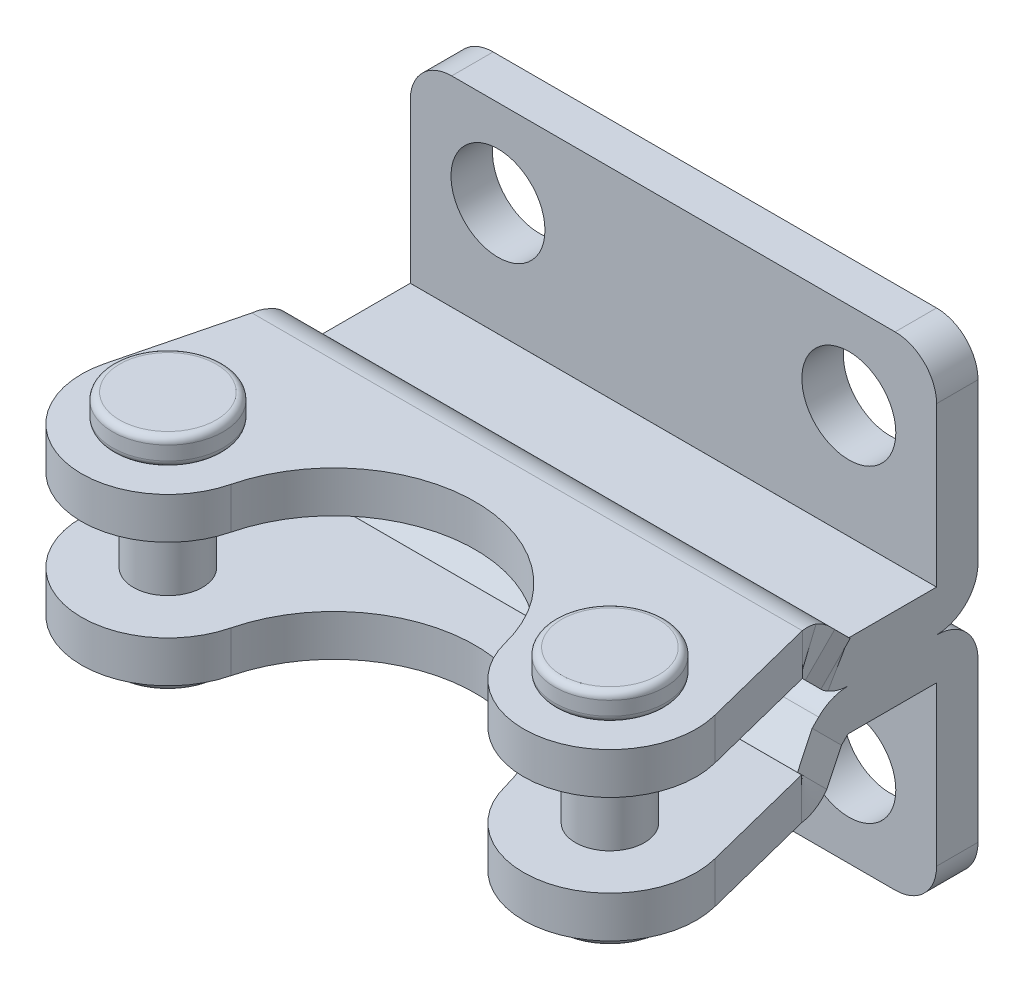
ISO-10303-21;
HEADER;
FILE_DESCRIPTION(('STEP AP214'),'2;1');
FILE_NAME('part.step','',(''),(''),'','','');
FILE_SCHEMA(('AUTOMOTIVE_DESIGN { 1 0 10303 214 1 1 1 1 }'));
ENDSEC;
DATA;
#1=APPLICATION_CONTEXT('core data for automotive mechanical design processes');
#2=APPLICATION_PROTOCOL_DEFINITION('international standard','automotive_design',2000,#1);
#3=PRODUCT_CONTEXT('',#1,'mechanical');
#4=PRODUCT('Part','Part','',(#3));
#5=PRODUCT_RELATED_PRODUCT_CATEGORY('part','',(#4));
#6=PRODUCT_DEFINITION_FORMATION('','',#4);
#7=PRODUCT_DEFINITION_CONTEXT('part definition',#1,'design');
#8=PRODUCT_DEFINITION('design','',#6,#7);
#9=PRODUCT_DEFINITION_SHAPE('','',#8);
#10=(LENGTH_UNIT() NAMED_UNIT(*) SI_UNIT(.MILLI.,.METRE.));
#11=(NAMED_UNIT(*) PLANE_ANGLE_UNIT() SI_UNIT($,.RADIAN.));
#12=(NAMED_UNIT(*) SI_UNIT($,.STERADIAN.) SOLID_ANGLE_UNIT());
#13=UNCERTAINTY_MEASURE_WITH_UNIT(LENGTH_MEASURE(1.E-05),#10,'distance_accuracy_value','');
#14=(GEOMETRIC_REPRESENTATION_CONTEXT(3) GLOBAL_UNCERTAINTY_ASSIGNED_CONTEXT((#13)) GLOBAL_UNIT_ASSIGNED_CONTEXT((#10,
#11,#12)) REPRESENTATION_CONTEXT('',''));
#15=CARTESIAN_POINT('',(0.,0.,0.));
#16=DIRECTION('',(0.,0.,1.));
#17=DIRECTION('',(1.,0.,0.));
#18=AXIS2_PLACEMENT_3D('',#15,#16,#17);
#19=CARTESIAN_POINT('',(-3.2999999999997,7.49999999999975,23.5942347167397));
#20=DIRECTION('',(0.,-1.,0.));
#21=DIRECTION('',(-0.579099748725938,0.,-0.815256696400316));
#22=AXIS2_PLACEMENT_3D('',#19,#20,#21);
#23=CYLINDRICAL_SURFACE('',#22,2.5);
#24=CARTESIAN_POINT('',(-3.2999999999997,2.99999999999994,23.5942347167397));
#25=DIRECTION('',(0.,-1.,0.));
#26=DIRECTION('',(0.,0.,-1.));
#27=AXIS2_PLACEMENT_3D('',#24,#25,#26);
#28=CIRCLE('',#27,2.5);
#29=CARTESIAN_POINT('',(-3.2999999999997,2.99999999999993,21.0942347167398));
#30=VERTEX_POINT('',#29);
#31=EDGE_CURVE('E9',#30,#30,#28,.F.);
#32=ORIENTED_EDGE('',*,*,#31,.F.);
#33=EDGE_LOOP('',(#32));
#34=FACE_BOUND('',#33,.T.);
#35=CARTESIAN_POINT('',(-3.2999999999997,-3.00000000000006,23.5942347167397));
#36=DIRECTION('',(0.,-1.,0.));
#37=DIRECTION('',(0.,0.,-1.));
#38=AXIS2_PLACEMENT_3D('',#35,#36,#37);
#39=CIRCLE('',#38,2.5);
#40=CARTESIAN_POINT('',(-3.2999999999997,-3.00000000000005,21.0942347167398));
#41=VERTEX_POINT('',#40);
#42=EDGE_CURVE('E28',#41,#41,#39,.F.);
#43=ORIENTED_EDGE('',*,*,#42,.T.);
#44=EDGE_LOOP('',(#43));
#45=FACE_BOUND('',#44,.T.);
#46=ADVANCED_FACE('F14',(#34,#45),#23,.T.);
#47=CARTESIAN_POINT('',(-3.2999999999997,-8.00000000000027,23.5942347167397));
#48=DIRECTION('',(0.,1.,0.));
#49=DIRECTION('',(0.579099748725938,0.,0.815256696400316));
#50=AXIS2_PLACEMENT_3D('',#47,#48,#49);
#51=PLANE('',#50);
#52=CARTESIAN_POINT('',(-3.2999999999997,-8.00000000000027,23.5942347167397));
#53=DIRECTION('',(0.,1.,0.));
#54=DIRECTION('',(0.579099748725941,0.,0.815256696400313));
#55=AXIS2_PLACEMENT_3D('',#52,#53,#54);
#56=CIRCLE('',#55,3.50000000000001);
#57=CARTESIAN_POINT('',(-1.2731508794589,-8.00000000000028,26.4476331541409));
#58=VERTEX_POINT('',#57);
#59=CARTESIAN_POINT('',(-5.3268491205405,-8.00000000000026,20.7408362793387));
#60=VERTEX_POINT('',#59);
#61=EDGE_CURVE('E1788',#58,#60,#56,.T.);
#62=ORIENTED_EDGE('',*,*,#61,.F.);
#63=CARTESIAN_POINT('',(-3.2999999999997,-8.00000000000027,23.5942347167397));
#64=DIRECTION('',(0.,1.,0.));
#65=DIRECTION('',(-0.579099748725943,0.,-0.815256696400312));
#66=AXIS2_PLACEMENT_3D('',#63,#64,#65);
#67=CIRCLE('',#66,3.50000000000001);
#68=EDGE_CURVE('E2174',#60,#58,#67,.T.);
#69=ORIENTED_EDGE('',*,*,#68,.F.);
#70=EDGE_LOOP('',(#62,#69));
#71=FACE_BOUND('',#70,.T.);
#72=ADVANCED_FACE('F433',(#71),#51,.F.);
#73=CARTESIAN_POINT('',(-3.2999999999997,-7.50000000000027,23.5942347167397));
#74=DIRECTION('',(0.,1.,0.));
#75=DIRECTION('',(0.579099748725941,0.,0.815256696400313));
#76=AXIS2_PLACEMENT_3D('',#73,#74,#75);
#77=TOROIDAL_SURFACE('',#76,3.50000000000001,0.5);
#78=ORIENTED_EDGE('',*,*,#61,.T.);
#79=ORIENTED_EDGE('',*,*,#68,.T.);
#80=EDGE_LOOP('',(#78,#79));
#81=FACE_BOUND('',#80,.T.);
#82=CARTESIAN_POINT('',(-3.2999999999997,-7.50000000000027,23.5942347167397));
#83=DIRECTION('',(0.,-1.,0.));
#84=DIRECTION('',(-0.579099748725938,0.,-0.815256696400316));
#85=AXIS2_PLACEMENT_3D('',#82,#83,#84);
#86=CIRCLE('',#85,4.);
#87=CARTESIAN_POINT('',(-5.61639899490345,-7.50000000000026,20.3332079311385));
#88=VERTEX_POINT('',#87);
#89=EDGE_CURVE('E468',#88,#88,#86,.F.);
#90=ORIENTED_EDGE('',*,*,#89,.F.);
#91=EDGE_LOOP('',(#90));
#92=FACE_BOUND('',#91,.T.);
#93=ADVANCED_FACE('F480',(#81,#92),#77,.T.);
#94=CARTESIAN_POINT('',(-3.2999999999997,-6.00000000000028,23.5942347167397));
#95=DIRECTION('',(0.,-1.,0.));
#96=DIRECTION('',(-0.579099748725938,0.,-0.815256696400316));
#97=AXIS2_PLACEMENT_3D('',#94,#95,#96);
#98=CYLINDRICAL_SURFACE('',#97,4.);
#99=CARTESIAN_POINT('',(-3.2999999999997,-6.50000000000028,23.5942347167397));
#100=DIRECTION('',(0.,1.,0.));
#101=DIRECTION('',(0.579099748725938,0.,0.815256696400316));
#102=AXIS2_PLACEMENT_3D('',#99,#100,#101);
#103=CIRCLE('',#102,4.);
#104=CARTESIAN_POINT('',(-0.983601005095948,-6.50000000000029,26.855261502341));
#105=VERTEX_POINT('',#104);
#106=EDGE_CURVE('E460',#105,#105,#103,.T.);
#107=ORIENTED_EDGE('',*,*,#106,.F.);
#108=EDGE_LOOP('',(#107));
#109=FACE_BOUND('',#108,.T.);
#110=ORIENTED_EDGE('',*,*,#89,.T.);
#111=EDGE_LOOP('',(#110));
#112=FACE_BOUND('',#111,.T.);
#113=ADVANCED_FACE('F485',(#109,#112),#98,.T.);
#114=CARTESIAN_POINT('',(-3.2999999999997,-6.50000000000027,23.5942347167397));
#115=DIRECTION('',(0.,1.,0.));
#116=DIRECTION('',(0.579099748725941,0.,0.815256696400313));
#117=AXIS2_PLACEMENT_3D('',#114,#115,#116);
#118=TOROIDAL_SURFACE('',#117,3.50000000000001,0.5);
#119=ORIENTED_EDGE('',*,*,#106,.T.);
#120=EDGE_LOOP('',(#119));
#121=FACE_BOUND('',#120,.T.);
#122=CARTESIAN_POINT('',(-3.2999999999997,-6.00000000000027,23.5942347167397));
#123=DIRECTION('',(0.,-1.,0.));
#124=DIRECTION('',(0.579099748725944,0.,0.815256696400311));
#125=AXIS2_PLACEMENT_3D('',#122,#123,#124);
#126=CIRCLE('',#125,3.50000000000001);
#127=CARTESIAN_POINT('',(-5.3268491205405,-6.00000000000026,20.7408362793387));
#128=VERTEX_POINT('',#127);
#129=CARTESIAN_POINT('',(-1.2731508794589,-6.00000000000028,26.4476331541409));
#130=VERTEX_POINT('',#129);
#131=EDGE_CURVE('E36',#128,#130,#126,.F.);
#132=ORIENTED_EDGE('',*,*,#131,.F.);
#133=CARTESIAN_POINT('',(-3.2999999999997,-6.00000000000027,23.5942347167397));
#134=DIRECTION('',(0.,-1.,0.));
#135=DIRECTION('',(-0.579099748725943,0.,-0.815256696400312));
#136=AXIS2_PLACEMENT_3D('',#133,#134,#135);
#137=CIRCLE('',#136,3.50000000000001);
#138=EDGE_CURVE('E461',#130,#128,#137,.F.);
#139=ORIENTED_EDGE('',*,*,#138,.F.);
#140=EDGE_LOOP('',(#132,#139));
#141=FACE_BOUND('',#140,.T.);
#142=ADVANCED_FACE('F1295',(#121,#141),#118,.T.);
#143=CARTESIAN_POINT('',(-3.2999999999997,7.99999999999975,23.5942347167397));
#144=DIRECTION('',(0.,-1.,0.));
#145=DIRECTION('',(-0.579099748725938,0.,-0.815256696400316));
#146=AXIS2_PLACEMENT_3D('',#143,#144,#145);
#147=PLANE('',#146);
#148=CARTESIAN_POINT('',(-3.2999999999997,7.99999999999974,23.5942347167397));
#149=DIRECTION('',(0.,-1.,0.));
#150=DIRECTION('',(-0.579099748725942,0.,-0.815256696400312));
#151=AXIS2_PLACEMENT_3D('',#148,#149,#150);
#152=CIRCLE('',#151,3.50000000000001);
#153=CARTESIAN_POINT('',(-5.3268491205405,7.99999999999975,20.7408362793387));
#154=VERTEX_POINT('',#153);
#155=CARTESIAN_POINT('',(-1.2731508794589,7.9999999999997,26.4476331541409));
#156=VERTEX_POINT('',#155);
#157=EDGE_CURVE('E512',#154,#156,#152,.T.);
#158=ORIENTED_EDGE('',*,*,#157,.F.);
#159=CARTESIAN_POINT('',(-3.2999999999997,7.99999999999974,23.5942347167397));
#160=DIRECTION('',(0.,-1.,0.));
#161=DIRECTION('',(0.57909974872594,0.,0.815256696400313));
#162=AXIS2_PLACEMENT_3D('',#159,#160,#161);
#163=CIRCLE('',#162,3.50000000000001);
#164=EDGE_CURVE('E1767',#156,#154,#163,.T.);
#165=ORIENTED_EDGE('',*,*,#164,.F.);
#166=EDGE_LOOP('',(#158,#165));
#167=FACE_BOUND('',#166,.T.);
#168=ADVANCED_FACE('F1305',(#167),#147,.F.);
#169=CARTESIAN_POINT('',(-3.2999999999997,7.49999999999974,23.5942347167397));
#170=DIRECTION('',(0.,-1.,0.));
#171=DIRECTION('',(-0.579099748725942,0.,-0.815256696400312));
#172=AXIS2_PLACEMENT_3D('',#169,#170,#171);
#173=TOROIDAL_SURFACE('',#172,3.50000000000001,0.5);
#174=ORIENTED_EDGE('',*,*,#157,.T.);
#175=ORIENTED_EDGE('',*,*,#164,.T.);
#176=EDGE_LOOP('',(#174,#175));
#177=FACE_BOUND('',#176,.T.);
#178=CARTESIAN_POINT('',(-3.2999999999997,7.49999999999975,23.5942347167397));
#179=DIRECTION('',(0.,1.,0.));
#180=DIRECTION('',(0.579099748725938,0.,0.815256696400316));
#181=AXIS2_PLACEMENT_3D('',#178,#179,#180);
#182=CIRCLE('',#181,4.);
#183=CARTESIAN_POINT('',(-0.983601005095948,7.49999999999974,26.855261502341));
#184=VERTEX_POINT('',#183);
#185=EDGE_CURVE('E2177',#184,#184,#182,.F.);
#186=ORIENTED_EDGE('',*,*,#185,.F.);
#187=EDGE_LOOP('',(#186));
#188=FACE_BOUND('',#187,.T.);
#189=ADVANCED_FACE('F489',(#177,#188),#173,.T.);
#190=CARTESIAN_POINT('',(-3.2999999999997,5.99999999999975,23.5942347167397));
#191=DIRECTION('',(0.,1.,0.));
#192=DIRECTION('',(0.579099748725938,0.,0.815256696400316));
#193=AXIS2_PLACEMENT_3D('',#190,#191,#192);
#194=CYLINDRICAL_SURFACE('',#193,4.);
#195=CARTESIAN_POINT('',(-3.2999999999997,6.49999999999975,23.5942347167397));
#196=DIRECTION('',(0.,-1.,0.));
#197=DIRECTION('',(-0.579099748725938,0.,-0.815256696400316));
#198=AXIS2_PLACEMENT_3D('',#195,#196,#197);
#199=CIRCLE('',#198,4.);
#200=CARTESIAN_POINT('',(-5.61639899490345,6.49999999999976,20.3332079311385));
#201=VERTEX_POINT('',#200);
#202=EDGE_CURVE('E463',#201,#201,#199,.T.);
#203=ORIENTED_EDGE('',*,*,#202,.F.);
#204=EDGE_LOOP('',(#203));
#205=FACE_BOUND('',#204,.T.);
#206=ORIENTED_EDGE('',*,*,#185,.T.);
#207=EDGE_LOOP('',(#206));
#208=FACE_BOUND('',#207,.T.);
#209=ADVANCED_FACE('F487',(#205,#208),#194,.T.);
#210=CARTESIAN_POINT('',(-3.2999999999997,6.49999999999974,23.5942347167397));
#211=DIRECTION('',(0.,-1.,0.));
#212=DIRECTION('',(-0.579099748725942,0.,-0.815256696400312));
#213=AXIS2_PLACEMENT_3D('',#210,#211,#212);
#214=TOROIDAL_SURFACE('',#213,3.50000000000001,0.5);
#215=ORIENTED_EDGE('',*,*,#202,.T.);
#216=EDGE_LOOP('',(#215));
#217=FACE_BOUND('',#216,.T.);
#218=CARTESIAN_POINT('',(-3.2999999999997,5.99999999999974,23.5942347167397));
#219=DIRECTION('',(0.,1.,0.));
#220=DIRECTION('',(-0.579099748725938,0.,-0.815256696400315));
#221=AXIS2_PLACEMENT_3D('',#218,#219,#220);
#222=CIRCLE('',#221,3.50000000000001);
#223=CARTESIAN_POINT('',(-1.2731508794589,5.9999999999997,26.4476331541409));
#224=VERTEX_POINT('',#223);
#225=CARTESIAN_POINT('',(-5.3268491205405,5.99999999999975,20.7408362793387));
#226=VERTEX_POINT('',#225);
#227=EDGE_CURVE('E457',#224,#226,#222,.F.);
#228=ORIENTED_EDGE('',*,*,#227,.F.);
#229=CARTESIAN_POINT('',(-3.2999999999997,5.99999999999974,23.5942347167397));
#230=DIRECTION('',(0.,1.,0.));
#231=DIRECTION('',(0.57909974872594,0.,0.815256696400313));
#232=AXIS2_PLACEMENT_3D('',#229,#230,#231);
#233=CIRCLE('',#232,3.50000000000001);
#234=EDGE_CURVE('E456',#226,#224,#233,.F.);
#235=ORIENTED_EDGE('',*,*,#234,.F.);
#236=EDGE_LOOP('',(#228,#235));
#237=FACE_BOUND('',#236,.T.);
#238=ADVANCED_FACE('F1306',(#217,#237),#214,.T.);
#239=CARTESIAN_POINT('',(25.4,11.1999999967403,-1.85962356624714E-12));
#240=DIRECTION('',(0.,0.,-1.));
#241=DIRECTION('',(1.,0.,0.));
#242=AXIS2_PLACEMENT_3D('',#239,#240,#241);
#243=CYLINDRICAL_SURFACE('',#242,3.4);
#244=CARTESIAN_POINT('',(25.4,11.1999999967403,2.99999999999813));
#245=DIRECTION('',(0.,0.,-1.));
#246=DIRECTION('',(1.,0.,0.));
#247=AXIS2_PLACEMENT_3D('',#244,#245,#246);
#248=CIRCLE('',#247,3.4);
#249=CARTESIAN_POINT('',(28.8,11.1999999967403,2.99999999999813));
#250=VERTEX_POINT('',#249);
#251=EDGE_CURVE('E729',#250,#250,#248,.F.);
#252=ORIENTED_EDGE('',*,*,#251,.T.);
#253=EDGE_LOOP('',(#252));
#254=FACE_BOUND('',#253,.T.);
#255=CARTESIAN_POINT('',(25.4,11.1999999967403,-1.85962356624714E-12));
#256=DIRECTION('',(0.,0.,-1.));
#257=DIRECTION('',(1.,0.,0.));
#258=AXIS2_PLACEMENT_3D('',#255,#256,#257);
#259=CIRCLE('',#258,3.4);
#260=CARTESIAN_POINT('',(28.8,11.1999999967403,-1.85900713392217E-12));
#261=VERTEX_POINT('',#260);
#262=EDGE_CURVE('E734',#261,#261,#259,.F.);
#263=ORIENTED_EDGE('',*,*,#262,.F.);
#264=EDGE_LOOP('',(#263));
#265=FACE_BOUND('',#264,.T.);
#266=ADVANCED_FACE('F1337',(#254,#265),#243,.F.);
#267=CARTESIAN_POINT('',(-2.01227923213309E-13,11.1999999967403,-1.85962356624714E-12));
#268=DIRECTION('',(0.,0.,-1.));
#269=DIRECTION('',(1.,0.,0.));
#270=AXIS2_PLACEMENT_3D('',#267,#268,#269);
#271=CYLINDRICAL_SURFACE('',#270,3.4);
#272=CARTESIAN_POINT('',(-2.01227923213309E-13,11.1999999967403,2.99999999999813));
#273=DIRECTION('',(0.,0.,-1.));
#274=DIRECTION('',(1.,0.,0.));
#275=AXIS2_PLACEMENT_3D('',#272,#273,#274);
#276=CIRCLE('',#275,3.4);
#277=CARTESIAN_POINT('',(3.3999999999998,11.1999999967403,2.99999999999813));
#278=VERTEX_POINT('',#277);
#279=EDGE_CURVE('E2136',#278,#278,#276,.F.);
#280=ORIENTED_EDGE('',*,*,#279,.T.);
#281=EDGE_LOOP('',(#280));
#282=FACE_BOUND('',#281,.T.);
#283=CARTESIAN_POINT('',(-2.01227923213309E-13,11.1999999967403,-1.85962356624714E-12));
#284=DIRECTION('',(0.,0.,-1.));
#285=DIRECTION('',(1.,0.,0.));
#286=AXIS2_PLACEMENT_3D('',#283,#284,#285);
#287=CIRCLE('',#286,3.4);
#288=CARTESIAN_POINT('',(3.3999999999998,11.1999999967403,-1.85900713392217E-12));
#289=VERTEX_POINT('',#288);
#290=EDGE_CURVE('E2069',#289,#289,#287,.F.);
#291=ORIENTED_EDGE('',*,*,#290,.F.);
#292=EDGE_LOOP('',(#291));
#293=FACE_BOUND('',#292,.T.);
#294=ADVANCED_FACE('F1345',(#282,#293),#271,.F.);
#295=CARTESIAN_POINT('',(-6.3500000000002,17.4999999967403,-1.85962356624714E-12));
#296=DIRECTION('',(0.,-1.,0.));
#297=DIRECTION('',(-1.,0.,0.));
#298=AXIS2_PLACEMENT_3D('',#295,#296,#297);
#299=PLANE('',#298);
#300=DIRECTION('',(0.,0.,-1.));
#301=VECTOR('',#300,1.);
#302=CARTESIAN_POINT('',(-3.3500000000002,17.4999999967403,-1.85962356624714E-12));
#303=LINE('',#302,#301);
#304=CARTESIAN_POINT('',(-3.3500000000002,17.4999999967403,2.99999999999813));
#305=VERTEX_POINT('',#304);
#306=CARTESIAN_POINT('',(-3.3500000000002,17.4999999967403,-1.85962356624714E-12));
#307=VERTEX_POINT('',#306);
#308=EDGE_CURVE('E705',#305,#307,#303,.T.);
#309=ORIENTED_EDGE('',*,*,#308,.F.);
#310=DIRECTION('',(1.,0.,0.));
#311=VECTOR('',#310,1.);
#312=CARTESIAN_POINT('',(12.6999999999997,17.4999999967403,2.99999999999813));
#313=LINE('',#312,#311);
#314=CARTESIAN_POINT('',(28.75,17.4999999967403,2.99999999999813));
#315=VERTEX_POINT('',#314);
#316=EDGE_CURVE('E693',#305,#315,#313,.T.);
#317=ORIENTED_EDGE('',*,*,#316,.T.);
#318=DIRECTION('',(0.,0.,-1.));
#319=VECTOR('',#318,1.);
#320=CARTESIAN_POINT('',(28.75,17.4999999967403,-1.85962356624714E-12));
#321=LINE('',#320,#319);
#322=CARTESIAN_POINT('',(28.75,17.4999999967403,-1.85962356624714E-12));
#323=VERTEX_POINT('',#322);
#324=EDGE_CURVE('E709',#323,#315,#321,.F.);
#325=ORIENTED_EDGE('',*,*,#324,.F.);
#326=DIRECTION('',(-1.,0.,0.));
#327=VECTOR('',#326,1.);
#328=CARTESIAN_POINT('',(-6.3500000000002,17.4999999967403,-1.85962356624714E-12));
#329=LINE('',#328,#327);
#330=EDGE_CURVE('E708',#307,#323,#329,.F.);
#331=ORIENTED_EDGE('',*,*,#330,.F.);
#332=EDGE_LOOP('',(#309,#317,#325,#331));
#333=FACE_BOUND('',#332,.T.);
#334=ADVANCED_FACE('F1354',(#333),#299,.F.);
#335=CARTESIAN_POINT('',(-3.3500000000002,14.4999999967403,-1.85962356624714E-12));
#336=DIRECTION('',(0.,0.,1.));
#337=DIRECTION('',(-1.,0.,0.));
#338=AXIS2_PLACEMENT_3D('',#335,#336,#337);
#339=CYLINDRICAL_SURFACE('',#338,3.);
#340=CARTESIAN_POINT('',(-3.3500000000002,14.4999999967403,2.99999999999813));
#341=DIRECTION('',(0.,0.,1.));
#342=DIRECTION('',(-1.,0.,0.));
#343=AXIS2_PLACEMENT_3D('',#340,#341,#342);
#344=CIRCLE('',#343,3.);
#345=CARTESIAN_POINT('',(-6.3500000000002,14.4999999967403,2.99999999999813));
#346=VERTEX_POINT('',#345);
#347=EDGE_CURVE('E696',#346,#305,#344,.F.);
#348=ORIENTED_EDGE('',*,*,#347,.T.);
#349=ORIENTED_EDGE('',*,*,#308,.T.);
#350=CARTESIAN_POINT('',(-3.3500000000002,14.4999999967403,-1.85962356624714E-12));
#351=DIRECTION('',(0.,0.,1.));
#352=DIRECTION('',(-1.,0.,0.));
#353=AXIS2_PLACEMENT_3D('',#350,#351,#352);
#354=CIRCLE('',#353,3.);
#355=CARTESIAN_POINT('',(-6.3500000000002,14.4999999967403,-1.85962356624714E-12));
#356=VERTEX_POINT('',#355);
#357=EDGE_CURVE('E714',#307,#356,#354,.T.);
#358=ORIENTED_EDGE('',*,*,#357,.T.);
#359=DIRECTION('',(0.,0.,1.));
#360=VECTOR('',#359,1.);
#361=CARTESIAN_POINT('',(-6.3500000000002,14.4999999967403,-1.85962356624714E-12));
#362=LINE('',#361,#360);
#363=EDGE_CURVE('E712',#356,#346,#362,.T.);
#364=ORIENTED_EDGE('',*,*,#363,.T.);
#365=EDGE_LOOP('',(#348,#349,#358,#364));
#366=FACE_BOUND('',#365,.T.);
#367=ADVANCED_FACE('F1366',(#366),#339,.T.);
#368=CARTESIAN_POINT('',(12.6999999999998,-23.9400000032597,-1.85962356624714E-12));
#369=DIRECTION('',(0.,0.,-1.));
#370=DIRECTION('',(1.,0.,0.));
#371=AXIS2_PLACEMENT_3D('',#368,#369,#370);
#372=PLANE('',#371);
#373=DIRECTION('',(0.,1.,0.));
#374=VECTOR('',#373,1.);
#375=CARTESIAN_POINT('',(31.75,17.4999999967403,-1.85962356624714E-12));
#376=LINE('',#375,#374);
#377=CARTESIAN_POINT('',(31.75,14.4999999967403,-1.85962356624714E-12));
#378=VERTEX_POINT('',#377);
#379=CARTESIAN_POINT('',(31.75,3.00099999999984,-1.85962356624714E-12));
#380=VERTEX_POINT('',#379);
#381=EDGE_CURVE('E725',#378,#380,#376,.F.);
#382=ORIENTED_EDGE('',*,*,#381,.T.);
#383=DIRECTION('',(1.,0.,0.));
#384=VECTOR('',#383,1.);
#385=CARTESIAN_POINT('',(12.6999999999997,3.00099999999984,-1.85962356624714E-12));
#386=LINE('',#385,#384);
#387=CARTESIAN_POINT('',(-6.3500000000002,3.00099999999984,-1.85962356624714E-12));
#388=VERTEX_POINT('',#387);
#389=EDGE_CURVE('E732',#380,#388,#386,.F.);
#390=ORIENTED_EDGE('',*,*,#389,.T.);
#391=DIRECTION('',(0.,-1.,0.));
#392=VECTOR('',#391,1.);
#393=CARTESIAN_POINT('',(-6.3500000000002,-6.50000000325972,-1.85962356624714E-12));
#394=LINE('',#393,#392);
#395=EDGE_CURVE('E720',#388,#356,#394,.F.);
#396=ORIENTED_EDGE('',*,*,#395,.T.);
#397=ORIENTED_EDGE('',*,*,#357,.F.);
#398=ORIENTED_EDGE('',*,*,#330,.T.);
#399=CARTESIAN_POINT('',(28.75,14.4999999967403,-1.85962356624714E-12));
#400=DIRECTION('',(0.,0.,1.));
#401=DIRECTION('',(-1.,0.,0.));
#402=AXIS2_PLACEMENT_3D('',#399,#400,#401);
#403=CIRCLE('',#402,3.);
#404=EDGE_CURVE('E726',#378,#323,#403,.T.);
#405=ORIENTED_EDGE('',*,*,#404,.F.);
#406=EDGE_LOOP('',(#382,#390,#396,#397,#398,#405));
#407=FACE_BOUND('',#406,.T.);
#408=ORIENTED_EDGE('',*,*,#290,.T.);
#409=EDGE_LOOP('',(#408));
#410=FACE_BOUND('',#409,.T.);
#411=ORIENTED_EDGE('',*,*,#262,.T.);
#412=EDGE_LOOP('',(#411));
#413=FACE_BOUND('',#412,.T.);
#414=ADVANCED_FACE('F965',(#407,#410,#413),#372,.T.);
#415=CARTESIAN_POINT('',(50.9905870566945,3.00099999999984,3.00099999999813));
#416=DIRECTION('',(-1.,0.,0.));
#417=DIRECTION('',(0.,1.,0.));
#418=AXIS2_PLACEMENT_3D('',#415,#416,#417);
#419=CYLINDRICAL_SURFACE('',#418,0.00100000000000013);
#420=CARTESIAN_POINT('',(31.75,3.00099999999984,3.00099999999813));
#421=DIRECTION('',(1.,0.,0.));
#422=DIRECTION('',(0.,-1.,0.));
#423=AXIS2_PLACEMENT_3D('',#420,#421,#422);
#424=CIRCLE('',#423,0.00100000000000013);
#425=CARTESIAN_POINT('',(31.75,3.00099999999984,2.99999999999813));
#426=VERTEX_POINT('',#425);
#427=CARTESIAN_POINT('',(31.75,2.99999999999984,3.00099999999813));
#428=VERTEX_POINT('',#427);
#429=EDGE_CURVE('E824',#426,#428,#424,.F.);
#430=ORIENTED_EDGE('',*,*,#429,.F.);
#431=DIRECTION('',(1.,0.,0.));
#432=VECTOR('',#431,1.);
#433=CARTESIAN_POINT('',(12.6999999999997,3.00099999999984,2.99999999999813));
#434=LINE('',#433,#432);
#435=CARTESIAN_POINT('',(-6.3500000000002,3.00099999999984,2.99999999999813));
#436=VERTEX_POINT('',#435);
#437=EDGE_CURVE('E700',#426,#436,#434,.F.);
#438=ORIENTED_EDGE('',*,*,#437,.T.);
#439=CARTESIAN_POINT('',(-6.3500000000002,3.00099999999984,3.00099999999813));
#440=DIRECTION('',(-1.,0.,0.));
#441=DIRECTION('',(0.,1.,0.));
#442=AXIS2_PLACEMENT_3D('',#439,#440,#441);
#443=CIRCLE('',#442,0.00100000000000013);
#444=CARTESIAN_POINT('',(-6.3500000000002,2.99999999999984,3.00099999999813));
#445=VERTEX_POINT('',#444);
#446=EDGE_CURVE('E721',#445,#436,#443,.F.);
#447=ORIENTED_EDGE('',*,*,#446,.F.);
#448=DIRECTION('',(-1.,0.,0.));
#449=VECTOR('',#448,1.);
#450=CARTESIAN_POINT('',(50.9905870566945,2.99999999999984,3.00099999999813));
#451=LINE('',#450,#449);
#452=EDGE_CURVE('E717',#428,#445,#451,.T.);
#453=ORIENTED_EDGE('',*,*,#452,.F.);
#454=EDGE_LOOP('',(#430,#438,#447,#453));
#455=FACE_BOUND('',#454,.T.);
#456=ADVANCED_FACE('F1388',(#455),#419,.F.);
#457=CARTESIAN_POINT('',(12.6999999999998,-23.9400000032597,2.99999999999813));
#458=DIRECTION('',(0.,0.,-1.));
#459=DIRECTION('',(1.,0.,0.));
#460=AXIS2_PLACEMENT_3D('',#457,#458,#459);
#461=PLANE('',#460);
#462=ORIENTED_EDGE('',*,*,#347,.F.);
#463=DIRECTION('',(0.,-1.,0.));
#464=VECTOR('',#463,1.);
#465=CARTESIAN_POINT('',(-6.3500000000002,-23.9400000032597,2.99999999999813));
#466=LINE('',#465,#464);
#467=EDGE_CURVE('E697',#436,#346,#466,.F.);
#468=ORIENTED_EDGE('',*,*,#467,.F.);
#469=ORIENTED_EDGE('',*,*,#437,.F.);
#470=DIRECTION('',(0.,-1.,0.));
#471=VECTOR('',#470,1.);
#472=CARTESIAN_POINT('',(31.75,-23.9400000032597,2.99999999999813));
#473=LINE('',#472,#471);
#474=CARTESIAN_POINT('',(31.75,14.4999999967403,2.99999999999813));
#475=VERTEX_POINT('',#474);
#476=EDGE_CURVE('E701',#475,#426,#473,.T.);
#477=ORIENTED_EDGE('',*,*,#476,.F.);
#478=CARTESIAN_POINT('',(28.75,14.4999999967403,2.99999999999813));
#479=DIRECTION('',(0.,0.,1.));
#480=DIRECTION('',(-1.,0.,0.));
#481=AXIS2_PLACEMENT_3D('',#478,#479,#480);
#482=CIRCLE('',#481,3.);
#483=EDGE_CURVE('E704',#315,#475,#482,.F.);
#484=ORIENTED_EDGE('',*,*,#483,.F.);
#485=ORIENTED_EDGE('',*,*,#316,.F.);
#486=EDGE_LOOP('',(#462,#468,#469,#477,#484,#485));
#487=FACE_BOUND('',#486,.T.);
#488=ORIENTED_EDGE('',*,*,#279,.F.);
#489=EDGE_LOOP('',(#488));
#490=FACE_BOUND('',#489,.T.);
#491=ORIENTED_EDGE('',*,*,#251,.F.);
#492=EDGE_LOOP('',(#491));
#493=FACE_BOUND('',#492,.T.);
#494=ADVANCED_FACE('F1369',(#487,#490,#493),#461,.F.);
#495=CARTESIAN_POINT('',(28.75,14.4999999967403,-1.85962356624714E-12));
#496=DIRECTION('',(0.,0.,1.));
#497=DIRECTION('',(-1.,0.,0.));
#498=AXIS2_PLACEMENT_3D('',#495,#496,#497);
#499=CYLINDRICAL_SURFACE('',#498,3.);
#500=ORIENTED_EDGE('',*,*,#483,.T.);
#501=DIRECTION('',(0.,0.,-1.));
#502=VECTOR('',#501,1.);
#503=CARTESIAN_POINT('',(31.75,14.4999999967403,-1.85962356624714E-12));
#504=LINE('',#503,#502);
#505=EDGE_CURVE('E722',#475,#378,#504,.T.);
#506=ORIENTED_EDGE('',*,*,#505,.T.);
#507=ORIENTED_EDGE('',*,*,#404,.T.);
#508=ORIENTED_EDGE('',*,*,#324,.T.);
#509=EDGE_LOOP('',(#500,#506,#507,#508));
#510=FACE_BOUND('',#509,.T.);
#511=ADVANCED_FACE('F1357',(#510),#499,.T.);
#512=CARTESIAN_POINT('',(50.9905870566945,3.00099999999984,3.00099999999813));
#513=DIRECTION('',(-1.,0.,0.));
#514=DIRECTION('',(0.,1.,0.));
#515=AXIS2_PLACEMENT_3D('',#512,#513,#514);
#516=CYLINDRICAL_SURFACE('',#515,3.001);
#517=ORIENTED_EDGE('',*,*,#389,.F.);
#518=CARTESIAN_POINT('',(31.75,3.00099999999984,3.00099999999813));
#519=DIRECTION('',(-1.,0.,0.));
#520=DIRECTION('',(0.,1.,0.));
#521=AXIS2_PLACEMENT_3D('',#518,#519,#520);
#522=CIRCLE('',#521,3.001);
#523=CARTESIAN_POINT('',(31.75,0.,3.00100000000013));
#524=VERTEX_POINT('',#523);
#525=EDGE_CURVE('E743',#524,#380,#522,.F.);
#526=ORIENTED_EDGE('',*,*,#525,.F.);
#527=DIRECTION('',(-1.,0.,0.));
#528=VECTOR('',#527,1.);
#529=CARTESIAN_POINT('',(50.9905870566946,0.,3.00100000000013));
#530=LINE('',#529,#528);
#531=CARTESIAN_POINT('',(-6.3500000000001,0.,3.00100000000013));
#532=VERTEX_POINT('',#531);
#533=EDGE_CURVE('E1834',#532,#524,#530,.F.);
#534=ORIENTED_EDGE('',*,*,#533,.F.);
#535=CARTESIAN_POINT('',(-6.3500000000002,3.00099999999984,3.00099999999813));
#536=DIRECTION('',(-1.,0.,0.));
#537=DIRECTION('',(0.,1.,0.));
#538=AXIS2_PLACEMENT_3D('',#535,#536,#537);
#539=CIRCLE('',#538,3.001);
#540=EDGE_CURVE('E735',#388,#532,#539,.T.);
#541=ORIENTED_EDGE('',*,*,#540,.F.);
#542=EDGE_LOOP('',(#517,#526,#534,#541));
#543=FACE_BOUND('',#542,.T.);
#544=ADVANCED_FACE('F774',(#543),#516,.T.);
#545=CARTESIAN_POINT('',(25.4,-11.1999999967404,3.));
#546=DIRECTION('',(0.,0.,1.));
#547=DIRECTION('',(1.,0.,0.));
#548=AXIS2_PLACEMENT_3D('',#545,#546,#547);
#549=CYLINDRICAL_SURFACE('',#548,3.4);
#550=CARTESIAN_POINT('',(25.4,-11.1999999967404,0.));
#551=DIRECTION('',(0.,0.,1.));
#552=DIRECTION('',(1.,0.,0.));
#553=AXIS2_PLACEMENT_3D('',#550,#551,#552);
#554=CIRCLE('',#553,3.4);
#555=CARTESIAN_POINT('',(28.8,-11.1999999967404,0.));
#556=VERTEX_POINT('',#555);
#557=EDGE_CURVE('E1825',#556,#556,#554,.F.);
#558=ORIENTED_EDGE('',*,*,#557,.T.);
#559=EDGE_LOOP('',(#558));
#560=FACE_BOUND('',#559,.T.);
#561=CARTESIAN_POINT('',(25.4,-11.1999999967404,3.));
#562=DIRECTION('',(0.,0.,1.));
#563=DIRECTION('',(1.,0.,0.));
#564=AXIS2_PLACEMENT_3D('',#561,#562,#563);
#565=CIRCLE('',#564,3.4);
#566=CARTESIAN_POINT('',(28.8,-11.1999999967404,3.));
#567=VERTEX_POINT('',#566);
#568=EDGE_CURVE('E1832',#567,#567,#565,.F.);
#569=ORIENTED_EDGE('',*,*,#568,.F.);
#570=EDGE_LOOP('',(#569));
#571=FACE_BOUND('',#570,.T.);
#572=ADVANCED_FACE('F1102',(#560,#571),#549,.F.);
#573=CARTESIAN_POINT('',(0.,-11.1999999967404,3.));
#574=DIRECTION('',(0.,0.,1.));
#575=DIRECTION('',(1.,0.,0.));
#576=AXIS2_PLACEMENT_3D('',#573,#574,#575);
#577=CYLINDRICAL_SURFACE('',#576,3.4);
#578=CARTESIAN_POINT('',(0.,-11.1999999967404,0.));
#579=DIRECTION('',(0.,0.,1.));
#580=DIRECTION('',(1.,0.,0.));
#581=AXIS2_PLACEMENT_3D('',#578,#579,#580);
#582=CIRCLE('',#581,3.4);
#583=CARTESIAN_POINT('',(3.4,-11.1999999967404,0.));
#584=VERTEX_POINT('',#583);
#585=EDGE_CURVE('E1980',#584,#584,#582,.F.);
#586=ORIENTED_EDGE('',*,*,#585,.T.);
#587=EDGE_LOOP('',(#586));
#588=FACE_BOUND('',#587,.T.);
#589=CARTESIAN_POINT('',(0.,-11.1999999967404,3.));
#590=DIRECTION('',(0.,0.,1.));
#591=DIRECTION('',(1.,0.,0.));
#592=AXIS2_PLACEMENT_3D('',#589,#590,#591);
#593=CIRCLE('',#592,3.4);
#594=CARTESIAN_POINT('',(3.4,-11.1999999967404,3.));
#595=VERTEX_POINT('',#594);
#596=EDGE_CURVE('E1990',#595,#595,#593,.F.);
#597=ORIENTED_EDGE('',*,*,#596,.F.);
#598=EDGE_LOOP('',(#597));
#599=FACE_BOUND('',#598,.T.);
#600=ADVANCED_FACE('F1433',(#588,#599),#577,.F.);
#601=CARTESIAN_POINT('',(-6.3500000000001,-17.4999999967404,3.));
#602=DIRECTION('',(0.,1.,0.));
#603=DIRECTION('',(0.,0.,1.));
#604=AXIS2_PLACEMENT_3D('',#601,#602,#603);
#605=PLANE('',#604);
#606=DIRECTION('',(0.,0.,1.));
#607=VECTOR('',#606,1.);
#608=CARTESIAN_POINT('',(-3.3500000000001,-17.4999999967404,3.));
#609=LINE('',#608,#607);
#610=CARTESIAN_POINT('',(-3.3500000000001,-17.4999999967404,0.));
#611=VERTEX_POINT('',#610);
#612=CARTESIAN_POINT('',(-3.3500000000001,-17.4999999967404,3.));
#613=VERTEX_POINT('',#612);
#614=EDGE_CURVE('E1806',#611,#613,#609,.T.);
#615=ORIENTED_EDGE('',*,*,#614,.F.);
#616=DIRECTION('',(1.,0.,0.));
#617=VECTOR('',#616,1.);
#618=CARTESIAN_POINT('',(12.7,-17.4999999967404,0.));
#619=LINE('',#618,#617);
#620=CARTESIAN_POINT('',(28.75,-17.4999999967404,0.));
#621=VERTEX_POINT('',#620);
#622=EDGE_CURVE('E680',#611,#621,#619,.T.);
#623=ORIENTED_EDGE('',*,*,#622,.T.);
#624=DIRECTION('',(0.,0.,1.));
#625=VECTOR('',#624,1.);
#626=CARTESIAN_POINT('',(28.75,-17.4999999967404,3.));
#627=LINE('',#626,#625);
#628=CARTESIAN_POINT('',(28.75,-17.4999999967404,3.));
#629=VERTEX_POINT('',#628);
#630=EDGE_CURVE('E1810',#629,#621,#627,.F.);
#631=ORIENTED_EDGE('',*,*,#630,.F.);
#632=DIRECTION('',(1.,0.,0.));
#633=VECTOR('',#632,1.);
#634=CARTESIAN_POINT('',(-6.3500000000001,-17.4999999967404,3.));
#635=LINE('',#634,#633);
#636=EDGE_CURVE('E1809',#613,#629,#635,.T.);
#637=ORIENTED_EDGE('',*,*,#636,.F.);
#638=EDGE_LOOP('',(#615,#623,#631,#637));
#639=FACE_BOUND('',#638,.T.);
#640=ADVANCED_FACE('F963',(#639),#605,.F.);
#641=CARTESIAN_POINT('',(12.6999999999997,2.99999999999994,28.6969279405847));
#642=DIRECTION('',(0.,-1.,0.));
#643=DIRECTION('',(0.,0.,-1.));
#644=AXIS2_PLACEMENT_3D('',#641,#642,#643);
#645=PLANE('',#644);
#646=DIRECTION('',(0.,0.,-1.));
#647=VECTOR('',#646,1.);
#648=CARTESIAN_POINT('',(31.75,2.99999999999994,28.6969279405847));
#649=LINE('',#648,#647);
#650=CARTESIAN_POINT('',(31.75,2.9999999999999,9.34205065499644));
#651=VERTEX_POINT('',#650);
#652=EDGE_CURVE('E736',#428,#651,#649,.F.);
#653=ORIENTED_EDGE('',*,*,#652,.F.);
#654=ORIENTED_EDGE('',*,*,#452,.T.);
#655=DIRECTION('',(0.,0.,-1.));
#656=VECTOR('',#655,1.);
#657=CARTESIAN_POINT('',(-6.3500000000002,2.99999999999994,28.6969279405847));
#658=LINE('',#657,#656);
#659=CARTESIAN_POINT('',(-6.3500000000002,2.9999999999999,9.34205065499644));
#660=VERTEX_POINT('',#659);
#661=EDGE_CURVE('E740',#660,#445,#658,.T.);
#662=ORIENTED_EDGE('',*,*,#661,.F.);
#663=DIRECTION('',(1.,0.,0.));
#664=VECTOR('',#663,1.);
#665=CARTESIAN_POINT('',(12.6999999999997,2.9999999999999,9.34205065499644));
#666=LINE('',#665,#664);
#667=EDGE_CURVE('E739',#651,#660,#666,.F.);
#668=ORIENTED_EDGE('',*,*,#667,.F.);
#669=EDGE_LOOP('',(#653,#654,#662,#668));
#670=FACE_BOUND('',#669,.T.);
#671=ADVANCED_FACE('F958',(#670),#645,.F.);
#672=CARTESIAN_POINT('',(28.7,7.9999999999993,23.5942347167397));
#673=DIRECTION('',(0.,-1.,0.));
#674=DIRECTION('',(0.999947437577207,0.,0.0102529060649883));
#675=AXIS2_PLACEMENT_3D('',#672,#673,#674);
#676=PLANE('',#675);
#677=CARTESIAN_POINT('',(28.7,7.9999999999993,23.5942347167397));
#678=DIRECTION('',(0.,-1.,0.));
#679=DIRECTION('',(0.999947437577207,0.,0.0102529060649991));
#680=AXIS2_PLACEMENT_3D('',#677,#678,#679);
#681=CIRCLE('',#680,3.50000000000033);
#682=CARTESIAN_POINT('',(32.1998160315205,7.9999999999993,23.6301198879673));
#683=VERTEX_POINT('',#682);
#684=CARTESIAN_POINT('',(25.2001839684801,7.9999999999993,23.5583495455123));
#685=VERTEX_POINT('',#684);
#686=EDGE_CURVE('E650',#683,#685,#681,.T.);
#687=ORIENTED_EDGE('',*,*,#686,.F.);
#688=CARTESIAN_POINT('',(28.7,7.9999999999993,23.5942347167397));
#689=DIRECTION('',(0.,-1.,0.));
#690=DIRECTION('',(-0.999947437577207,0.,-0.0102529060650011));
#691=AXIS2_PLACEMENT_3D('',#688,#689,#690);
#692=CIRCLE('',#691,3.50000000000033);
#693=EDGE_CURVE('E661',#685,#683,#692,.T.);
#694=ORIENTED_EDGE('',*,*,#693,.F.);
#695=EDGE_LOOP('',(#687,#694));
#696=FACE_BOUND('',#695,.T.);
#697=ADVANCED_FACE('F627',(#696),#676,.F.);
#698=CARTESIAN_POINT('',(28.7,-8.00000000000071,23.5942347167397));
#699=DIRECTION('',(0.,1.,0.));
#700=DIRECTION('',(-0.999947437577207,0.,-0.0102529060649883));
#701=AXIS2_PLACEMENT_3D('',#698,#699,#700);
#702=PLANE('',#701);
#703=CARTESIAN_POINT('',(28.7,-8.00000000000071,23.5942347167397));
#704=DIRECTION('',(0.,1.,0.));
#705=DIRECTION('',(-0.999947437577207,0.,-0.010252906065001));
#706=AXIS2_PLACEMENT_3D('',#703,#704,#705);
#707=CIRCLE('',#706,3.49999999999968);
#708=CARTESIAN_POINT('',(25.2001839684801,-8.00000000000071,23.5583495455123));
#709=VERTEX_POINT('',#708);
#710=CARTESIAN_POINT('',(32.1998160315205,-8.00000000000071,23.6301198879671));
#711=VERTEX_POINT('',#710);
#712=EDGE_CURVE('E571',#709,#711,#707,.T.);
#713=ORIENTED_EDGE('',*,*,#712,.F.);
#714=CARTESIAN_POINT('',(28.7,-8.00000000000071,23.5942347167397));
#715=DIRECTION('',(0.,1.,0.));
#716=DIRECTION('',(0.999947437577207,0.,0.010252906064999));
#717=AXIS2_PLACEMENT_3D('',#714,#715,#716);
#718=CIRCLE('',#717,3.49999999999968);
#719=EDGE_CURVE('E611',#711,#709,#718,.T.);
#720=ORIENTED_EDGE('',*,*,#719,.F.);
#721=EDGE_LOOP('',(#713,#720));
#722=FACE_BOUND('',#721,.T.);
#723=ADVANCED_FACE('F591',(#722),#702,.F.);
#724=CARTESIAN_POINT('',(31.75,0.38898607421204,10.8821435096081));
#725=CARTESIAN_POINT('',(31.7823045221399,0.519472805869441,11.1042129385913));
#726=CARTESIAN_POINT('',(31.8145978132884,0.678266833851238,11.3095267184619));
#727=CARTESIAN_POINT('',(31.8469023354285,0.860395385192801,11.4916552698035));
#728=CARTESIAN_POINT('',(31.75,0.414851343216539,10.8669452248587));
#729=CARTESIAN_POINT('',(31.782304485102,0.544050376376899,11.0868231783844));
#730=CARTESIAN_POINT('',(31.8145978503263,0.701277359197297,11.2901108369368));
#731=CARTESIAN_POINT('',(31.8469023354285,0.881608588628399,11.4704420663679));
#732=CARTESIAN_POINT('',(31.75,3.00137824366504,9.34711674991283));
#733=CARTESIAN_POINT('',(31.7823007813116,3.00180742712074,9.34784715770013));
#734=CARTESIAN_POINT('',(31.8146015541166,3.00232989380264,9.34852268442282));
#735=CARTESIAN_POINT('',(31.8469023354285,3.002928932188,9.34912172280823));
#736=B_SPLINE_SURFACE_WITH_KNOTS('',1,3,((#724,#725,#726,#727),(#728,#729,#730,#731),(#732,#733,
#734,#735)),.UNSPECIFIED.,.F.,.F.,.F.,(2,1,2),(4,4),(-0.01,0.,1.),(0.,1.),.UNSPECIFIED.);
#737=DIRECTION('',(0.,-0.707106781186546,0.707106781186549));
#738=VECTOR('',#737,1.);
#739=CARTESIAN_POINT('',(31.8469023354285,3.002928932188,9.34912172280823));
#740=LINE('',#739,#738);
#741=CARTESIAN_POINT('',(31.8469023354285,3.002928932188,9.34912172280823));
#742=VERTEX_POINT('',#741);
#743=CARTESIAN_POINT('',(31.8469023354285,0.881608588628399,11.4704420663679));
#744=VERTEX_POINT('',#743);
#745=EDGE_CURVE('E831',#742,#744,#740,.T.);
#746=CARTESIAN_POINT('',(31.7499999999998,0.414851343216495,10.8669452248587));
#747=CARTESIAN_POINT('',(31.7540375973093,0.430999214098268,10.8944269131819));
#748=CARTESIAN_POINT('',(31.7580751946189,0.447583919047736,10.9216519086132));
#749=CARTESIAN_POINT('',(31.7661503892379,0.481609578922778,10.9755614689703));
#750=CARTESIAN_POINT('',(31.7701879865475,0.499050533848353,11.0022460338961));
#751=CARTESIAN_POINT('',(31.7782631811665,0.53477127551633,11.0550476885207));
#752=CARTESIAN_POINT('',(31.782300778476,0.553051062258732,11.0811647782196));
#753=CARTESIAN_POINT('',(31.7903759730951,0.590430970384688,11.1328051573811));
#754=CARTESIAN_POINT('',(31.7944135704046,0.609531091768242,11.1583284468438));
#755=CARTESIAN_POINT('',(31.8024887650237,0.648532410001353,11.208755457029));
#756=CARTESIAN_POINT('',(31.8065263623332,0.66843360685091,11.2336591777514));
#757=CARTESIAN_POINT('',(31.8146015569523,0.709016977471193,11.282821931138));
#758=CARTESIAN_POINT('',(31.8186391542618,0.729699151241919,11.3070809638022));
#759=CARTESIAN_POINT('',(31.8267143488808,0.771823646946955,11.354929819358));
#760=CARTESIAN_POINT('',(31.8307519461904,0.793265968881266,11.3785196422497));
#761=CARTESIAN_POINT('',(31.8388271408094,0.836888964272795,11.4250064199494));
#762=CARTESIAN_POINT('',(31.842864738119,0.859069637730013,11.4479033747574));
#763=CARTESIAN_POINT('',(31.8469023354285,0.881608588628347,11.4704420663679));
#764=B_SPLINE_CURVE_WITH_KNOTS('',3,(#746,#747,#748,#749,#750,#751,#752,#753,#754,#755,#756,
#757,#758,#759,#760,#761,#762,#763),.UNSPECIFIED.,.F.,.F.,(4,2,2,2,2,2,2,2,4),(0.,
0.0963842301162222,0.192768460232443,0.289152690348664,0.385536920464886,0.481921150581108,
0.578305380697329,0.674689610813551,0.771073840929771),.UNSPECIFIED.);
#765=CARTESIAN_POINT('',(31.75,0.414851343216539,10.8669452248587));
#766=VERTEX_POINT('',#765);
#767=EDGE_CURVE('E782',#766,#744,#764,.T.);
#768=DIRECTION('',(0.,-0.862175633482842,0.506609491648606));
#769=VECTOR('',#768,1.);
#770=CARTESIAN_POINT('',(31.75,3.00137824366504,9.34711674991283));
#771=LINE('',#770,#769);
#772=CARTESIAN_POINT('',(31.75,3.00137824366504,9.34711674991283));
#773=VERTEX_POINT('',#772);
#774=EDGE_CURVE('E759',#773,#766,#771,.T.);
#775=CARTESIAN_POINT('',(31.7499999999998,3.00137824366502,9.34711674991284));
#776=CARTESIAN_POINT('',(31.7540375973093,3.00143189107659,9.34720805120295));
#777=CARTESIAN_POINT('',(31.7580751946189,3.00148698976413,9.34729849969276));
#778=CARTESIAN_POINT('',(31.7661503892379,3.00160003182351,9.34747760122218));
#779=CARTESIAN_POINT('',(31.7701879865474,3.00165797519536,9.3475662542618));
#780=CARTESIAN_POINT('',(31.7782631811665,3.00177664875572,9.34774167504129));
#781=CARTESIAN_POINT('',(31.782300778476,3.00183737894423,9.34782844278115));
#782=CARTESIAN_POINT('',(31.7903759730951,3.00196156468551,9.34800000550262));
#783=CARTESIAN_POINT('',(31.7944135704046,3.00202502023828,9.34808480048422));
#784=CARTESIAN_POINT('',(31.8024887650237,3.00215459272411,9.34825233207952));
#785=CARTESIAN_POINT('',(31.8065263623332,3.00222070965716,9.34833506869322));
#786=CARTESIAN_POINT('',(31.8146015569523,3.00235553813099,9.34849840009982));
#787=CARTESIAN_POINT('',(31.8186391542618,3.00242424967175,9.34857899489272));
#788=CARTESIAN_POINT('',(31.8267143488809,3.00256419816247,9.34873796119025));
#789=CARTESIAN_POINT('',(31.8307519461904,3.00263543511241,9.34881633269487));
#790=CARTESIAN_POINT('',(31.8388271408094,3.0027803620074,9.3489707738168));
#791=CARTESIAN_POINT('',(31.842864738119,3.00285405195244,9.3490468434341));
#792=CARTESIAN_POINT('',(31.8469023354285,3.00292893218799,9.34912172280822));
#793=B_SPLINE_CURVE_WITH_KNOTS('',3,(#775,#776,#777,#778,#779,#780,#781,#782,#783,#784,#785,
#786,#787,#788,#789,#790,#791,#792),.UNSPECIFIED.,.F.,.F.,(4,2,2,2,2,2,2,2,4),(0.,
0.0121169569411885,0.0242339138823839,0.0363508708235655,0.0484678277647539,0.0605847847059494,
0.0727017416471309,0.0848186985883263,0.0969356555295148),.UNSPECIFIED.);
#794=EDGE_CURVE('E778',#773,#742,#793,.T.);
#795=ORIENTED_EDGE('',*,*,#745,.T.);
#796=ORIENTED_EDGE('',*,*,#767,.F.);
#797=ORIENTED_EDGE('',*,*,#774,.F.);
#798=ORIENTED_EDGE('',*,*,#794,.T.);
#799=EDGE_LOOP('',(#795,#796,#797,#798));
#800=FACE_BOUND('',#799,.T.);
#801=ADVANCED_FACE('F626',(#800),#736,.T.);
#802=CARTESIAN_POINT('',(-6.4469023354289,0.860395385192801,11.4916552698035));
#803=CARTESIAN_POINT('',(-6.4145978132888,0.678266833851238,11.3095267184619));
#804=CARTESIAN_POINT('',(-6.3823045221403,0.5194728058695,11.1042129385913));
#805=CARTESIAN_POINT('',(-6.3500000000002,0.38898607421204,10.8821435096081));
#806=CARTESIAN_POINT('',(-6.4469023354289,0.881608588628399,11.4704420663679));
#807=CARTESIAN_POINT('',(-6.4145978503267,0.701277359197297,11.2901108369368));
#808=CARTESIAN_POINT('',(-6.3823044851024,0.544050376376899,11.0868231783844));
#809=CARTESIAN_POINT('',(-6.3500000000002,0.414851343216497,10.8669452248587));
#810=CARTESIAN_POINT('',(-6.4469023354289,3.002928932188,9.34912172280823));
#811=CARTESIAN_POINT('',(-6.4146015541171,3.0023298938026,9.34852268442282));
#812=CARTESIAN_POINT('',(-6.382300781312,3.00180742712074,9.34784715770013));
#813=CARTESIAN_POINT('',(-6.3500000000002,3.00137824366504,9.34711674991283));
#814=B_SPLINE_SURFACE_WITH_KNOTS('',1,3,((#802,#803,#804,#805),(#806,#807,#808,#809),(#810,#811,
#812,#813)),.UNSPECIFIED.,.F.,.F.,.F.,(2,1,2),(4,4),(-0.01,0.,1.),(0.,1.),.UNSPECIFIED.);
#815=DIRECTION('',(0.,0.862175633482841,-0.506609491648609));
#816=VECTOR('',#815,1.);
#817=CARTESIAN_POINT('',(-6.3500000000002,0.414851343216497,10.8669452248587));
#818=LINE('',#817,#816);
#819=CARTESIAN_POINT('',(-6.3500000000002,0.414851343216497,10.8669452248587));
#820=VERTEX_POINT('',#819);
#821=CARTESIAN_POINT('',(-6.3500000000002,3.00137824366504,9.34711674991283));
#822=VERTEX_POINT('',#821);
#823=EDGE_CURVE('E748',#820,#822,#818,.T.);
#824=CARTESIAN_POINT('',(-6.44690233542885,0.881608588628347,11.4704420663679));
#825=CARTESIAN_POINT('',(-6.44286473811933,0.859069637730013,11.4479033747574));
#826=CARTESIAN_POINT('',(-6.4388271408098,0.836888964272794,11.4250064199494));
#827=CARTESIAN_POINT('',(-6.43075194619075,0.793265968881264,11.3785196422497));
#828=CARTESIAN_POINT('',(-6.42671434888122,0.771823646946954,11.354929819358));
#829=CARTESIAN_POINT('',(-6.41863915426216,0.729699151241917,11.3070809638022));
#830=CARTESIAN_POINT('',(-6.41460155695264,0.709016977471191,11.282821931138));
#831=CARTESIAN_POINT('',(-6.40652636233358,0.668433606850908,11.2336591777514));
#832=CARTESIAN_POINT('',(-6.40248876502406,0.648532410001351,11.208755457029));
#833=CARTESIAN_POINT('',(-6.394413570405,0.60953109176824,11.1583284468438));
#834=CARTESIAN_POINT('',(-6.39037597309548,0.590430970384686,11.1328051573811));
#835=CARTESIAN_POINT('',(-6.38230077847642,0.55305106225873,11.0811647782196));
#836=CARTESIAN_POINT('',(-6.37826318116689,0.534771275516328,11.0550476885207));
#837=CARTESIAN_POINT('',(-6.37018798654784,0.49905053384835,11.0022460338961));
#838=CARTESIAN_POINT('',(-6.36615038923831,0.481609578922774,10.9755614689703));
#839=CARTESIAN_POINT('',(-6.35807519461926,0.447583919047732,10.9216519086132));
#840=CARTESIAN_POINT('',(-6.35403759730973,0.430999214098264,10.8944269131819));
#841=CARTESIAN_POINT('',(-6.3500000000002,0.414851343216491,10.8669452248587));
#842=B_SPLINE_CURVE_WITH_KNOTS('',3,(#824,#825,#826,#827,#828,#829,#830,#831,#832,#833,#834,
#835,#836,#837,#838,#839,#840,#841),.UNSPECIFIED.,.F.,.F.,(4,2,2,2,2,2,2,2,4),(0.,
0.0963842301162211,0.192768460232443,0.289152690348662,0.385536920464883,0.481921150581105,
0.578305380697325,0.674689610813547,0.771073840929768),.UNSPECIFIED.);
#843=CARTESIAN_POINT('',(-6.4469023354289,0.881608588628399,11.4704420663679));
#844=VERTEX_POINT('',#843);
#845=EDGE_CURVE('E757',#844,#820,#842,.T.);
#846=DIRECTION('',(0.,0.707106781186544,-0.707106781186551));
#847=VECTOR('',#846,1.);
#848=CARTESIAN_POINT('',(-6.4469023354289,1.9422687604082,10.409781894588));
#849=LINE('',#848,#847);
#850=CARTESIAN_POINT('',(-6.4469023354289,3.002928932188,9.34912172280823));
#851=VERTEX_POINT('',#850);
#852=EDGE_CURVE('E758',#844,#851,#849,.T.);
#853=CARTESIAN_POINT('',(-6.44690233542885,3.00292893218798,9.34912172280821));
#854=CARTESIAN_POINT('',(-6.44286473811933,3.00285405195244,9.34904684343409));
#855=CARTESIAN_POINT('',(-6.4388271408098,3.0027803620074,9.34897077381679));
#856=CARTESIAN_POINT('',(-6.43075194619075,3.00263543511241,9.34881633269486));
#857=CARTESIAN_POINT('',(-6.42671434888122,3.00256419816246,9.34873796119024));
#858=CARTESIAN_POINT('',(-6.41863915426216,3.00242424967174,9.34857899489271));
#859=CARTESIAN_POINT('',(-6.41460155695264,3.00235553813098,9.34849840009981));
#860=CARTESIAN_POINT('',(-6.40652636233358,3.00222070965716,9.3483350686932));
#861=CARTESIAN_POINT('',(-6.40248876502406,3.0021545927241,9.34825233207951));
#862=CARTESIAN_POINT('',(-6.394413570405,3.00202502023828,9.34808480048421));
#863=CARTESIAN_POINT('',(-6.39037597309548,3.00196156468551,9.34800000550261));
#864=CARTESIAN_POINT('',(-6.38230077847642,3.00183737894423,9.34782844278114));
#865=CARTESIAN_POINT('',(-6.37826318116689,3.00177664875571,9.34774167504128));
#866=CARTESIAN_POINT('',(-6.37018798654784,3.00165797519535,9.34756625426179));
#867=CARTESIAN_POINT('',(-6.36615038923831,3.00160003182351,9.34747760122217));
#868=CARTESIAN_POINT('',(-6.35807519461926,3.00148698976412,9.34729849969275));
#869=CARTESIAN_POINT('',(-6.35403759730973,3.00143189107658,9.34720805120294));
#870=CARTESIAN_POINT('',(-6.3500000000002,3.00137824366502,9.34711674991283));
#871=B_SPLINE_CURVE_WITH_KNOTS('',3,(#853,#854,#855,#856,#857,#858,#859,#860,#861,#862,#863,
#864,#865,#866,#867,#868,#869,#870),.UNSPECIFIED.,.F.,.F.,(4,2,2,2,2,2,2,2,4),(0.,
0.0121169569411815,0.0242339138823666,0.0363508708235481,0.0484678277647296,0.0605847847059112,
0.0727017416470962,0.0848186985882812,0.0969356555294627),.UNSPECIFIED.);
#872=EDGE_CURVE('E753',#851,#822,#871,.T.);
#873=ORIENTED_EDGE('',*,*,#823,.F.);
#874=ORIENTED_EDGE('',*,*,#845,.F.);
#875=ORIENTED_EDGE('',*,*,#852,.T.);
#876=ORIENTED_EDGE('',*,*,#872,.T.);
#877=EDGE_LOOP('',(#873,#874,#875,#876));
#878=FACE_BOUND('',#877,.T.);
#879=ADVANCED_FACE('F16',(#878),#814,.T.);
#880=CARTESIAN_POINT('',(-6.3500000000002,-6.50000000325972,-1.85962356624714E-12));
#881=DIRECTION('',(1.,0.,0.));
#882=DIRECTION('',(0.,-1.,0.));
#883=AXIS2_PLACEMENT_3D('',#880,#881,#882);
#884=PLANE('',#883);
#885=ORIENTED_EDGE('',*,*,#363,.F.);
#886=ORIENTED_EDGE('',*,*,#395,.F.);
#887=ORIENTED_EDGE('',*,*,#540,.T.);
#888=CARTESIAN_POINT('',(-6.3500000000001,-3.001,3.001));
#889=DIRECTION('',(-1.,0.,0.));
#890=DIRECTION('',(0.,0.,1.));
#891=AXIS2_PLACEMENT_3D('',#888,#889,#890);
#892=CIRCLE('',#891,3.001);
#893=CARTESIAN_POINT('',(-6.3500000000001,-3.001,0.));
#894=VERTEX_POINT('',#893);
#895=EDGE_CURVE('E1829',#894,#532,#892,.F.);
#896=ORIENTED_EDGE('',*,*,#895,.F.);
#897=DIRECTION('',(0.,1.,0.));
#898=VECTOR('',#897,1.);
#899=CARTESIAN_POINT('',(-6.3500000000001,23.9400000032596,0.));
#900=LINE('',#899,#898);
#901=CARTESIAN_POINT('',(-6.3500000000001,-14.4999999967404,0.));
#902=VERTEX_POINT('',#901);
#903=EDGE_CURVE('E1798',#894,#902,#900,.F.);
#904=ORIENTED_EDGE('',*,*,#903,.T.);
#905=DIRECTION('',(0.,0.,-1.));
#906=VECTOR('',#905,1.);
#907=CARTESIAN_POINT('',(-6.3500000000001,-14.4999999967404,3.));
#908=LINE('',#907,#906);
#909=CARTESIAN_POINT('',(-6.3500000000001,-14.4999999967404,3.));
#910=VERTEX_POINT('',#909);
#911=EDGE_CURVE('E1813',#910,#902,#908,.T.);
#912=ORIENTED_EDGE('',*,*,#911,.F.);
#913=DIRECTION('',(0.,1.,0.));
#914=VECTOR('',#913,1.);
#915=CARTESIAN_POINT('',(-6.3500000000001,6.5000000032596,3.));
#916=LINE('',#915,#914);
#917=CARTESIAN_POINT('',(-6.3500000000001,-3.001,3.));
#918=VERTEX_POINT('',#917);
#919=EDGE_CURVE('E1826',#918,#910,#916,.F.);
#920=ORIENTED_EDGE('',*,*,#919,.F.);
#921=CARTESIAN_POINT('',(-6.35,-3.001,3.001));
#922=DIRECTION('',(-1.,0.,0.));
#923=DIRECTION('',(0.,0.,1.));
#924=AXIS2_PLACEMENT_3D('',#921,#922,#923);
#925=CIRCLE('',#924,0.00100000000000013);
#926=CARTESIAN_POINT('',(-6.3500000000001,-3.,3.00100000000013));
#927=VERTEX_POINT('',#926);
#928=EDGE_CURVE('E1833',#927,#918,#925,.T.);
#929=ORIENTED_EDGE('',*,*,#928,.F.);
#930=DIRECTION('',(0.,0.,-1.));
#931=VECTOR('',#930,1.);
#932=CARTESIAN_POINT('',(-6.3500000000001,-3.,10.1442347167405));
#933=LINE('',#932,#931);
#934=CARTESIAN_POINT('',(-6.3500000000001,-3.,9.40702438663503));
#935=VERTEX_POINT('',#934);
#936=EDGE_CURVE('E1848',#935,#927,#933,.T.);
#937=ORIENTED_EDGE('',*,*,#936,.F.);
#938=CARTESIAN_POINT('',(-6.35,-3.01,9.40702438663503));
#939=DIRECTION('',(-1.,0.,0.));
#940=DIRECTION('',(0.,0.,1.));
#941=AXIS2_PLACEMENT_3D('',#938,#939,#940);
#942=CIRCLE('',#941,0.00999999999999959);
#943=CARTESIAN_POINT('',(-6.3500000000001,-3.00292893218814,9.41409545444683));
#944=VERTEX_POINT('',#943);
#945=EDGE_CURVE('E1861',#944,#935,#942,.T.);
#946=ORIENTED_EDGE('',*,*,#945,.F.);
#947=DIRECTION('',(0.,0.70710678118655,-0.707106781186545));
#948=VECTOR('',#947,1.);
#949=CARTESIAN_POINT('',(-6.3500000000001,-3.472414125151,9.88358064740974));
#950=LINE('',#949,#948);
#951=CARTESIAN_POINT('',(-6.3500000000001,-3.472414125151,9.88358064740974));
#952=VERTEX_POINT('',#951);
#953=EDGE_CURVE('E1879',#952,#944,#950,.T.);
#954=ORIENTED_EDGE('',*,*,#953,.F.);
#955=DIRECTION('',(0.,-0.707106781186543,-0.707106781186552));
#956=VECTOR('',#955,1.);
#957=CARTESIAN_POINT('',(-6.3500000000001,-1.3510937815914,12.0049009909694));
#958=LINE('',#957,#956);
#959=CARTESIAN_POINT('',(-6.3500000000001,-1.35109378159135,12.0049009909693));
#960=VERTEX_POINT('',#959);
#961=EDGE_CURVE('E1882',#960,#952,#958,.T.);
#962=ORIENTED_EDGE('',*,*,#961,.F.);
#963=DIRECTION('',(0.,0.707106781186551,-0.707106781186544));
#964=VECTOR('',#963,1.);
#965=CARTESIAN_POINT('',(-6.3500000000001,-12.8962431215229,23.5500503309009));
#966=LINE('',#965,#964);
#967=CARTESIAN_POINT('',(-6.3500000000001,-0.881608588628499,11.5354157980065));
#968=VERTEX_POINT('',#967);
#969=EDGE_CURVE('E1865',#960,#968,#966,.T.);
#970=ORIENTED_EDGE('',*,*,#969,.T.);
#971=CARTESIAN_POINT('',(-6.3500000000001,-3.01,9.40702438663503));
#972=DIRECTION('',(-1.,0.,0.));
#973=DIRECTION('',(0.,0.,1.));
#974=AXIS2_PLACEMENT_3D('',#971,#972,#973);
#975=CIRCLE('',#974,3.01);
#976=CARTESIAN_POINT('',(-6.3500000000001,0.,9.40702438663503));
#977=VERTEX_POINT('',#976);
#978=EDGE_CURVE('E1854',#977,#968,#975,.F.);
#979=ORIENTED_EDGE('',*,*,#978,.F.);
#980=DIRECTION('',(0.,0.,-1.));
#981=VECTOR('',#980,1.);
#982=CARTESIAN_POINT('',(-6.3500000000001,0.,27.5842347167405));
#983=LINE('',#982,#981);
#984=CARTESIAN_POINT('',(-6.3500000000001,0.,9.34205065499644));
#985=VERTEX_POINT('',#984);
#986=EDGE_CURVE('E1837',#977,#985,#983,.T.);
#987=ORIENTED_EDGE('',*,*,#986,.T.);
#988=CARTESIAN_POINT('',(-6.3500000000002,3.0099999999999,9.34205065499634));
#989=DIRECTION('',(1.,0.,0.));
#990=DIRECTION('',(0.,0.,1.));
#991=AXIS2_PLACEMENT_3D('',#988,#989,#990);
#992=CIRCLE('',#991,3.01);
#993=EDGE_CURVE('E752',#985,#820,#992,.F.);
#994=ORIENTED_EDGE('',*,*,#993,.T.);
#995=ORIENTED_EDGE('',*,*,#823,.T.);
#996=CARTESIAN_POINT('',(-6.3500000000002,3.0099999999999,9.34205065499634));
#997=DIRECTION('',(1.,0.,0.));
#998=DIRECTION('',(0.,0.,1.));
#999=AXIS2_PLACEMENT_3D('',#996,#997,#998);
#1000=CIRCLE('',#999,0.00999999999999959);
#1001=EDGE_CURVE('E751',#822,#660,#1000,.T.);
#1002=ORIENTED_EDGE('',*,*,#1001,.T.);
#1003=ORIENTED_EDGE('',*,*,#661,.T.);
#1004=ORIENTED_EDGE('',*,*,#446,.T.);
#1005=ORIENTED_EDGE('',*,*,#467,.T.);
#1006=EDGE_LOOP('',(#885,#886,#887,#896,#904,#912,#920,#929,#937,#946,#954,#962,#970,#979,#987,
#994,#995,#1002,#1003,#1004,#1005));
#1007=FACE_BOUND('',#1006,.T.);
#1008=ADVANCED_FACE('F1380',(#1007),#884,.F.);
#1009=CARTESIAN_POINT('',(-3.3500000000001,-14.4999999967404,3.));
#1010=DIRECTION('',(0.,0.,-1.));
#1011=DIRECTION('',(-1.,0.,0.));
#1012=AXIS2_PLACEMENT_3D('',#1009,#1010,#1011);
#1013=CYLINDRICAL_SURFACE('',#1012,3.);
#1014=CARTESIAN_POINT('',(-3.3500000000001,-14.4999999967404,0.));
#1015=DIRECTION('',(0.,0.,-1.));
#1016=DIRECTION('',(-1.,0.,0.));
#1017=AXIS2_PLACEMENT_3D('',#1014,#1015,#1016);
#1018=CIRCLE('',#1017,3.);
#1019=EDGE_CURVE('E687',#902,#611,#1018,.F.);
#1020=ORIENTED_EDGE('',*,*,#1019,.T.);
#1021=ORIENTED_EDGE('',*,*,#614,.T.);
#1022=CARTESIAN_POINT('',(-3.3500000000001,-14.4999999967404,3.));
#1023=DIRECTION('',(0.,0.,-1.));
#1024=DIRECTION('',(-1.,0.,0.));
#1025=AXIS2_PLACEMENT_3D('',#1022,#1023,#1024);
#1026=CIRCLE('',#1025,3.);
#1027=EDGE_CURVE('E1815',#613,#910,#1026,.T.);
#1028=ORIENTED_EDGE('',*,*,#1027,.T.);
#1029=ORIENTED_EDGE('',*,*,#911,.T.);
#1030=EDGE_LOOP('',(#1020,#1021,#1028,#1029));
#1031=FACE_BOUND('',#1030,.T.);
#1032=ADVANCED_FACE('F1410',(#1031),#1013,.T.);
#1033=CARTESIAN_POINT('',(12.7,23.9400000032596,3.));
#1034=DIRECTION('',(0.,0.,1.));
#1035=DIRECTION('',(1.,0.,0.));
#1036=AXIS2_PLACEMENT_3D('',#1033,#1034,#1035);
#1037=PLANE('',#1036);
#1038=DIRECTION('',(0.,1.,0.));
#1039=VECTOR('',#1038,1.);
#1040=CARTESIAN_POINT('',(31.75,-17.4999999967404,3.));
#1041=LINE('',#1040,#1039);
#1042=CARTESIAN_POINT('',(31.75,-14.4999999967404,3.));
#1043=VERTEX_POINT('',#1042);
#1044=CARTESIAN_POINT('',(31.75,-3.001,3.));
#1045=VERTEX_POINT('',#1044);
#1046=EDGE_CURVE('E1821',#1043,#1045,#1041,.T.);
#1047=ORIENTED_EDGE('',*,*,#1046,.T.);
#1048=DIRECTION('',(1.,0.,0.));
#1049=VECTOR('',#1048,1.);
#1050=CARTESIAN_POINT('',(12.7,-3.001,3.));
#1051=LINE('',#1050,#1049);
#1052=EDGE_CURVE('E1830',#1045,#918,#1051,.F.);
#1053=ORIENTED_EDGE('',*,*,#1052,.T.);
#1054=ORIENTED_EDGE('',*,*,#919,.T.);
#1055=ORIENTED_EDGE('',*,*,#1027,.F.);
#1056=ORIENTED_EDGE('',*,*,#636,.T.);
#1057=CARTESIAN_POINT('',(28.75,-14.4999999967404,3.));
#1058=DIRECTION('',(0.,0.,-1.));
#1059=DIRECTION('',(-1.,0.,0.));
#1060=AXIS2_PLACEMENT_3D('',#1057,#1058,#1059);
#1061=CIRCLE('',#1060,3.);
#1062=EDGE_CURVE('E1822',#1043,#629,#1061,.T.);
#1063=ORIENTED_EDGE('',*,*,#1062,.F.);
#1064=EDGE_LOOP('',(#1047,#1053,#1054,#1055,#1056,#1063));
#1065=FACE_BOUND('',#1064,.T.);
#1066=ORIENTED_EDGE('',*,*,#596,.T.);
#1067=EDGE_LOOP('',(#1066));
#1068=FACE_BOUND('',#1067,.T.);
#1069=ORIENTED_EDGE('',*,*,#568,.T.);
#1070=EDGE_LOOP('',(#1069));
#1071=FACE_BOUND('',#1070,.T.);
#1072=ADVANCED_FACE('F1501',(#1065,#1068,#1071),#1037,.T.);
#1073=CARTESIAN_POINT('',(50.9905870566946,-3.001,3.001));
#1074=DIRECTION('',(-1.,0.,0.));
#1075=DIRECTION('',(0.,0.,1.));
#1076=AXIS2_PLACEMENT_3D('',#1073,#1074,#1075);
#1077=CYLINDRICAL_SURFACE('',#1076,0.00100000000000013);
#1078=ORIENTED_EDGE('',*,*,#928,.T.);
#1079=ORIENTED_EDGE('',*,*,#1052,.F.);
#1080=CARTESIAN_POINT('',(31.75,-3.001,3.001));
#1081=DIRECTION('',(-1.,0.,0.));
#1082=DIRECTION('',(0.,0.,1.));
#1083=AXIS2_PLACEMENT_3D('',#1080,#1081,#1082);
#1084=CIRCLE('',#1083,0.00100000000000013);
#1085=CARTESIAN_POINT('',(31.75,-3.,3.001));
#1086=VERTEX_POINT('',#1085);
#1087=EDGE_CURVE('E1857',#1045,#1086,#1084,.F.);
#1088=ORIENTED_EDGE('',*,*,#1087,.T.);
#1089=DIRECTION('',(-1.,0.,0.));
#1090=VECTOR('',#1089,1.);
#1091=CARTESIAN_POINT('',(50.9905870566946,-3.,3.001));
#1092=LINE('',#1091,#1090);
#1093=EDGE_CURVE('E1841',#927,#1086,#1092,.F.);
#1094=ORIENTED_EDGE('',*,*,#1093,.F.);
#1095=EDGE_LOOP('',(#1078,#1079,#1088,#1094));
#1096=FACE_BOUND('',#1095,.T.);
#1097=ADVANCED_FACE('F1511',(#1096),#1077,.F.);
#1098=CARTESIAN_POINT('',(12.7,-3.00000000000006,27.5842347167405));
#1099=DIRECTION('',(0.,-1.,0.));
#1100=DIRECTION('',(0.,0.,-1.));
#1101=AXIS2_PLACEMENT_3D('',#1098,#1099,#1100);
#1102=PLANE('',#1101);
#1103=ORIENTED_EDGE('',*,*,#936,.T.);
#1104=ORIENTED_EDGE('',*,*,#1093,.T.);
#1105=DIRECTION('',(0.,0.,1.));
#1106=VECTOR('',#1105,1.);
#1107=CARTESIAN_POINT('',(31.75,-3.,-13.8557652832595));
#1108=LINE('',#1107,#1106);
#1109=CARTESIAN_POINT('',(31.75,-3.,9.40702438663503));
#1110=VERTEX_POINT('',#1109);
#1111=EDGE_CURVE('E1851',#1086,#1110,#1108,.T.);
#1112=ORIENTED_EDGE('',*,*,#1111,.T.);
#1113=DIRECTION('',(1.,0.,0.));
#1114=VECTOR('',#1113,1.);
#1115=CARTESIAN_POINT('',(12.7,-3.,9.40702438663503));
#1116=LINE('',#1115,#1114);
#1117=EDGE_CURVE('E1858',#1110,#935,#1116,.F.);
#1118=ORIENTED_EDGE('',*,*,#1117,.T.);
#1119=EDGE_LOOP('',(#1103,#1104,#1112,#1118));
#1120=FACE_BOUND('',#1119,.T.);
#1121=ADVANCED_FACE('F973',(#1120),#1102,.T.);
#1122=CARTESIAN_POINT('',(12.7,0.,27.5842347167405));
#1123=DIRECTION('',(0.,-1.,0.));
#1124=DIRECTION('',(0.,0.,-1.));
#1125=AXIS2_PLACEMENT_3D('',#1122,#1123,#1124);
#1126=PLANE('',#1125);
#1127=DIRECTION('',(1.,0.,0.));
#1128=VECTOR('',#1127,1.);
#1129=CARTESIAN_POINT('',(-25.8219114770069,0.,9.34205065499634));
#1130=LINE('',#1129,#1128);
#1131=CARTESIAN_POINT('',(31.75,0.,9.34205065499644));
#1132=VERTEX_POINT('',#1131);
#1133=EDGE_CURVE('E679',#985,#1132,#1130,.T.);
#1134=ORIENTED_EDGE('',*,*,#1133,.F.);
#1135=ORIENTED_EDGE('',*,*,#986,.F.);
#1136=DIRECTION('',(1.,0.,0.));
#1137=VECTOR('',#1136,1.);
#1138=CARTESIAN_POINT('',(12.7,0.,9.40702438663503));
#1139=LINE('',#1138,#1137);
#1140=CARTESIAN_POINT('',(31.75,0.,9.40702438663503));
#1141=VERTEX_POINT('',#1140);
#1142=EDGE_CURVE('E1843',#1141,#977,#1139,.F.);
#1143=ORIENTED_EDGE('',*,*,#1142,.F.);
#1144=DIRECTION('',(0.,0.,-1.));
#1145=VECTOR('',#1144,1.);
#1146=CARTESIAN_POINT('',(31.75,0.,27.5842347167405));
#1147=LINE('',#1146,#1145);
#1148=EDGE_CURVE('E1840',#1132,#1141,#1147,.F.);
#1149=ORIENTED_EDGE('',*,*,#1148,.F.);
#1150=EDGE_LOOP('',(#1134,#1135,#1143,#1149));
#1151=FACE_BOUND('',#1150,.T.);
#1152=ADVANCED_FACE('F1530',(#1151),#1126,.F.);
#1153=CARTESIAN_POINT('',(31.75,17.4999999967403,-1.85962356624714E-12));
#1154=DIRECTION('',(-1.,0.,0.));
#1155=DIRECTION('',(0.,1.,0.));
#1156=AXIS2_PLACEMENT_3D('',#1153,#1154,#1155);
#1157=PLANE('',#1156);
#1158=ORIENTED_EDGE('',*,*,#505,.F.);
#1159=ORIENTED_EDGE('',*,*,#476,.T.);
#1160=ORIENTED_EDGE('',*,*,#429,.T.);
#1161=ORIENTED_EDGE('',*,*,#652,.T.);
#1162=CARTESIAN_POINT('',(31.75,3.0099999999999,9.34205065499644));
#1163=DIRECTION('',(1.,0.,0.));
#1164=DIRECTION('',(0.,0.,1.));
#1165=AXIS2_PLACEMENT_3D('',#1162,#1163,#1164);
#1166=CIRCLE('',#1165,0.00999999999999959);
#1167=EDGE_CURVE('E2085',#651,#773,#1166,.F.);
#1168=ORIENTED_EDGE('',*,*,#1167,.T.);
#1169=ORIENTED_EDGE('',*,*,#774,.T.);
#1170=CARTESIAN_POINT('',(31.75,3.0099999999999,9.34205065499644));
#1171=DIRECTION('',(1.,0.,0.));
#1172=DIRECTION('',(0.,0.,1.));
#1173=AXIS2_PLACEMENT_3D('',#1170,#1171,#1172);
#1174=CIRCLE('',#1173,3.01);
#1175=EDGE_CURVE('E876',#766,#1132,#1174,.T.);
#1176=ORIENTED_EDGE('',*,*,#1175,.T.);
#1177=ORIENTED_EDGE('',*,*,#1148,.T.);
#1178=CARTESIAN_POINT('',(31.75,-3.01,9.40702438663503));
#1179=DIRECTION('',(-1.,0.,0.));
#1180=DIRECTION('',(0.,0.,1.));
#1181=AXIS2_PLACEMENT_3D('',#1178,#1179,#1180);
#1182=CIRCLE('',#1181,3.01);
#1183=CARTESIAN_POINT('',(31.75,-0.881608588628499,11.5354157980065));
#1184=VERTEX_POINT('',#1183);
#1185=EDGE_CURVE('E1864',#1184,#1141,#1182,.T.);
#1186=ORIENTED_EDGE('',*,*,#1185,.F.);
#1187=DIRECTION('',(0.,0.707106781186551,-0.707106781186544));
#1188=VECTOR('',#1187,1.);
#1189=CARTESIAN_POINT('',(31.75,-12.8962431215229,23.5500503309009));
#1190=LINE('',#1189,#1188);
#1191=CARTESIAN_POINT('',(31.75,-1.3510937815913,12.0049009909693));
#1192=VERTEX_POINT('',#1191);
#1193=EDGE_CURVE('E1867',#1184,#1192,#1190,.F.);
#1194=ORIENTED_EDGE('',*,*,#1193,.T.);
#1195=DIRECTION('',(0.,0.707106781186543,0.707106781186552));
#1196=VECTOR('',#1195,1.);
#1197=CARTESIAN_POINT('',(31.75,-3.472414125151,9.88358064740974));
#1198=LINE('',#1197,#1196);
#1199=CARTESIAN_POINT('',(31.75,-3.472414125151,9.88358064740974));
#1200=VERTEX_POINT('',#1199);
#1201=EDGE_CURVE('E1888',#1200,#1192,#1198,.T.);
#1202=ORIENTED_EDGE('',*,*,#1201,.F.);
#1203=DIRECTION('',(0.,-0.707106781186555,0.70710678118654));
#1204=VECTOR('',#1203,1.);
#1205=CARTESIAN_POINT('',(31.75,-3.00292893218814,9.41409545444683));
#1206=LINE('',#1205,#1204);
#1207=CARTESIAN_POINT('',(31.75,-3.00292893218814,9.41409545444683));
#1208=VERTEX_POINT('',#1207);
#1209=EDGE_CURVE('E1885',#1208,#1200,#1206,.T.);
#1210=ORIENTED_EDGE('',*,*,#1209,.F.);
#1211=CARTESIAN_POINT('',(31.75,-3.01,9.40702438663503));
#1212=DIRECTION('',(-1.,0.,0.));
#1213=DIRECTION('',(0.,0.,1.));
#1214=AXIS2_PLACEMENT_3D('',#1211,#1212,#1213);
#1215=CIRCLE('',#1214,0.00999999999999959);
#1216=EDGE_CURVE('E1923',#1110,#1208,#1215,.F.);
#1217=ORIENTED_EDGE('',*,*,#1216,.F.);
#1218=ORIENTED_EDGE('',*,*,#1111,.F.);
#1219=ORIENTED_EDGE('',*,*,#1087,.F.);
#1220=ORIENTED_EDGE('',*,*,#1046,.F.);
#1221=DIRECTION('',(0.,0.,1.));
#1222=VECTOR('',#1221,1.);
#1223=CARTESIAN_POINT('',(31.75,-14.4999999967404,3.));
#1224=LINE('',#1223,#1222);
#1225=CARTESIAN_POINT('',(31.75,-14.4999999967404,0.));
#1226=VERTEX_POINT('',#1225);
#1227=EDGE_CURVE('E1818',#1226,#1043,#1224,.T.);
#1228=ORIENTED_EDGE('',*,*,#1227,.F.);
#1229=DIRECTION('',(0.,1.,0.));
#1230=VECTOR('',#1229,1.);
#1231=CARTESIAN_POINT('',(31.75,23.9400000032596,0.));
#1232=LINE('',#1231,#1230);
#1233=CARTESIAN_POINT('',(31.75,-3.001,0.));
#1234=VERTEX_POINT('',#1233);
#1235=EDGE_CURVE('E1802',#1226,#1234,#1232,.T.);
#1236=ORIENTED_EDGE('',*,*,#1235,.T.);
#1237=CARTESIAN_POINT('',(31.75,-3.001,3.001));
#1238=DIRECTION('',(-1.,0.,0.));
#1239=DIRECTION('',(0.,0.,1.));
#1240=AXIS2_PLACEMENT_3D('',#1237,#1238,#1239);
#1241=CIRCLE('',#1240,3.001);
#1242=EDGE_CURVE('E1836',#524,#1234,#1241,.T.);
#1243=ORIENTED_EDGE('',*,*,#1242,.F.);
#1244=ORIENTED_EDGE('',*,*,#525,.T.);
#1245=ORIENTED_EDGE('',*,*,#381,.F.);
#1246=EDGE_LOOP('',(#1158,#1159,#1160,#1161,#1168,#1169,#1176,#1177,#1186,#1194,#1202,#1210,
#1217,#1218,#1219,#1220,#1228,#1236,#1243,#1244,#1245));
#1247=FACE_BOUND('',#1246,.T.);
#1248=ADVANCED_FACE('F1400',(#1247),#1157,.F.);
#1249=CARTESIAN_POINT('',(50.9905870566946,-3.001,3.001));
#1250=DIRECTION('',(-1.,0.,0.));
#1251=DIRECTION('',(0.,0.,1.));
#1252=AXIS2_PLACEMENT_3D('',#1249,#1250,#1251);
#1253=CYLINDRICAL_SURFACE('',#1252,3.001);
#1254=DIRECTION('',(1.,0.,0.));
#1255=VECTOR('',#1254,1.);
#1256=CARTESIAN_POINT('',(12.7,-3.00099999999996,0.));
#1257=LINE('',#1256,#1255);
#1258=EDGE_CURVE('E1801',#1234,#894,#1257,.F.);
#1259=ORIENTED_EDGE('',*,*,#1258,.T.);
#1260=ORIENTED_EDGE('',*,*,#895,.T.);
#1261=ORIENTED_EDGE('',*,*,#533,.T.);
#1262=ORIENTED_EDGE('',*,*,#1242,.T.);
#1263=EDGE_LOOP('',(#1259,#1260,#1261,#1262));
#1264=FACE_BOUND('',#1263,.T.);
#1265=ADVANCED_FACE('F1542',(#1264),#1253,.T.);
#1266=CARTESIAN_POINT('',(12.7,23.9400000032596,0.));
#1267=DIRECTION('',(0.,0.,1.));
#1268=DIRECTION('',(1.,0.,0.));
#1269=AXIS2_PLACEMENT_3D('',#1266,#1267,#1268);
#1270=PLANE('',#1269);
#1271=ORIENTED_EDGE('',*,*,#1019,.F.);
#1272=ORIENTED_EDGE('',*,*,#903,.F.);
#1273=ORIENTED_EDGE('',*,*,#1258,.F.);
#1274=ORIENTED_EDGE('',*,*,#1235,.F.);
#1275=CARTESIAN_POINT('',(28.75,-14.4999999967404,0.));
#1276=DIRECTION('',(0.,0.,-1.));
#1277=DIRECTION('',(-1.,0.,0.));
#1278=AXIS2_PLACEMENT_3D('',#1275,#1276,#1277);
#1279=CIRCLE('',#1278,3.);
#1280=EDGE_CURVE('E1805',#621,#1226,#1279,.F.);
#1281=ORIENTED_EDGE('',*,*,#1280,.F.);
#1282=ORIENTED_EDGE('',*,*,#622,.F.);
#1283=EDGE_LOOP('',(#1271,#1272,#1273,#1274,#1281,#1282));
#1284=FACE_BOUND('',#1283,.T.);
#1285=ORIENTED_EDGE('',*,*,#585,.F.);
#1286=EDGE_LOOP('',(#1285));
#1287=FACE_BOUND('',#1286,.T.);
#1288=ORIENTED_EDGE('',*,*,#557,.F.);
#1289=EDGE_LOOP('',(#1288));
#1290=FACE_BOUND('',#1289,.T.);
#1291=ADVANCED_FACE('F1559',(#1284,#1287,#1290),#1270,.F.);
#1292=CARTESIAN_POINT('',(28.75,-14.4999999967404,3.));
#1293=DIRECTION('',(0.,0.,-1.));
#1294=DIRECTION('',(-1.,0.,0.));
#1295=AXIS2_PLACEMENT_3D('',#1292,#1293,#1294);
#1296=CYLINDRICAL_SURFACE('',#1295,3.);
#1297=ORIENTED_EDGE('',*,*,#1280,.T.);
#1298=ORIENTED_EDGE('',*,*,#1227,.T.);
#1299=ORIENTED_EDGE('',*,*,#1062,.T.);
#1300=ORIENTED_EDGE('',*,*,#630,.T.);
#1301=EDGE_LOOP('',(#1297,#1298,#1299,#1300));
#1302=FACE_BOUND('',#1301,.T.);
#1303=ADVANCED_FACE('F771',(#1302),#1296,.T.);
#1304=CARTESIAN_POINT('',(-25.8219114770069,3.00999999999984,9.34205065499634));
#1305=DIRECTION('',(1.,0.,0.));
#1306=DIRECTION('',(0.,0.,1.));
#1307=AXIS2_PLACEMENT_3D('',#1304,#1305,#1306);
#1308=CYLINDRICAL_SURFACE('',#1307,0.00999999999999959);
#1309=DIRECTION('',(1.,0.,0.));
#1310=VECTOR('',#1309,1.);
#1311=CARTESIAN_POINT('',(-25.8219114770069,3.002928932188,9.34912172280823));
#1312=LINE('',#1311,#1310);
#1313=EDGE_CURVE('E821',#742,#851,#1312,.F.);
#1314=ORIENTED_EDGE('',*,*,#1313,.F.);
#1315=ORIENTED_EDGE('',*,*,#794,.F.);
#1316=ORIENTED_EDGE('',*,*,#1167,.F.);
#1317=ORIENTED_EDGE('',*,*,#667,.T.);
#1318=ORIENTED_EDGE('',*,*,#1001,.F.);
#1319=ORIENTED_EDGE('',*,*,#872,.F.);
#1320=EDGE_LOOP('',(#1314,#1315,#1316,#1317,#1318,#1319));
#1321=FACE_BOUND('',#1320,.T.);
#1322=ADVANCED_FACE('F761',(#1321),#1308,.F.);
#1323=CARTESIAN_POINT('',(28.7,7.4999999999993,23.5942347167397));
#1324=DIRECTION('',(0.,-1.,0.));
#1325=DIRECTION('',(0.999947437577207,0.,0.0102529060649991));
#1326=AXIS2_PLACEMENT_3D('',#1323,#1324,#1325);
#1327=TOROIDAL_SURFACE('',#1326,3.50000000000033,0.5);
#1328=ORIENTED_EDGE('',*,*,#686,.T.);
#1329=ORIENTED_EDGE('',*,*,#693,.T.);
#1330=EDGE_LOOP('',(#1328,#1329));
#1331=FACE_BOUND('',#1330,.T.);
#1332=CARTESIAN_POINT('',(28.7,7.4999999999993,23.5942347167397));
#1333=DIRECTION('',(0.,1.,0.));
#1334=DIRECTION('',(-0.999947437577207,0.,-0.0102529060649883));
#1335=AXIS2_PLACEMENT_3D('',#1332,#1333,#1334);
#1336=CIRCLE('',#1335,4.);
#1337=CARTESIAN_POINT('',(24.7002102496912,7.4999999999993,23.5532230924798));
#1338=VERTEX_POINT('',#1337);
#1339=EDGE_CURVE('E606',#1338,#1338,#1336,.F.);
#1340=ORIENTED_EDGE('',*,*,#1339,.F.);
#1341=EDGE_LOOP('',(#1340));
#1342=FACE_BOUND('',#1341,.T.);
#1343=ADVANCED_FACE('F593',(#1331,#1342),#1327,.T.);
#1344=CARTESIAN_POINT('',(50.936324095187,-3.01,9.40702438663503));
#1345=DIRECTION('',(-1.,0.,0.));
#1346=DIRECTION('',(0.,0.,1.));
#1347=AXIS2_PLACEMENT_3D('',#1344,#1345,#1346);
#1348=CYLINDRICAL_SURFACE('',#1347,0.00999999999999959);
#1349=ORIENTED_EDGE('',*,*,#945,.T.);
#1350=ORIENTED_EDGE('',*,*,#1117,.F.);
#1351=ORIENTED_EDGE('',*,*,#1216,.T.);
#1352=DIRECTION('',(-1.,0.,0.));
#1353=VECTOR('',#1352,1.);
#1354=CARTESIAN_POINT('',(50.936324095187,-3.00292893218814,9.41409545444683));
#1355=LINE('',#1354,#1353);
#1356=EDGE_CURVE('E1876',#944,#1208,#1355,.F.);
#1357=ORIENTED_EDGE('',*,*,#1356,.F.);
#1358=EDGE_LOOP('',(#1349,#1350,#1351,#1357));
#1359=FACE_BOUND('',#1358,.T.);
#1360=ADVANCED_FACE('F590',(#1359),#1348,.F.);
#1361=CARTESIAN_POINT('',(28.7,-7.50000000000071,23.5942347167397));
#1362=DIRECTION('',(0.,1.,0.));
#1363=DIRECTION('',(-0.999947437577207,0.,-0.010252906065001));
#1364=AXIS2_PLACEMENT_3D('',#1361,#1362,#1363);
#1365=TOROIDAL_SURFACE('',#1364,3.49999999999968,0.5);
#1366=ORIENTED_EDGE('',*,*,#712,.T.);
#1367=ORIENTED_EDGE('',*,*,#719,.T.);
#1368=EDGE_LOOP('',(#1366,#1367));
#1369=FACE_BOUND('',#1368,.T.);
#1370=CARTESIAN_POINT('',(28.7,-7.50000000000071,23.5942347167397));
#1371=DIRECTION('',(0.,-1.,0.));
#1372=DIRECTION('',(0.999947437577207,0.,0.0102529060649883));
#1373=AXIS2_PLACEMENT_3D('',#1370,#1371,#1372);
#1374=CIRCLE('',#1373,4.);
#1375=CARTESIAN_POINT('',(32.6997897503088,-7.50000000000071,23.6352463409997));
#1376=VERTEX_POINT('',#1375);
#1377=EDGE_CURVE('E604',#1376,#1376,#1374,.F.);
#1378=ORIENTED_EDGE('',*,*,#1377,.F.);
#1379=EDGE_LOOP('',(#1378));
#1380=FACE_BOUND('',#1379,.T.);
#1381=ADVANCED_FACE('F578',(#1369,#1380),#1365,.T.);
#1382=CARTESIAN_POINT('',(34.7598050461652,9.0388732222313,19.6277066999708));
#1383=DIRECTION('',(-0.969568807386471,0.173113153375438,0.173113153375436));
#1384=DIRECTION('',(0.175766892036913,0.984431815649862,0.));
#1385=AXIS2_PLACEMENT_3D('',#1382,#1383,#1384);
#1386=PLANE('',#1385);
#1387=ORIENTED_EDGE('',*,*,#745,.F.);
#1388=DIRECTION('',(0.244818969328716,0.685588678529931,0.685588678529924));
#1389=VECTOR('',#1388,1.);
#1390=CARTESIAN_POINT('',(31.8469023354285,3.002928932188,9.34912172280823));
#1391=LINE('',#1390,#1389);
#1392=CARTESIAN_POINT('',(32.4710891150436,4.7508955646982,11.0970883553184));
#1393=VERTEX_POINT('',#1392);
#1394=EDGE_CURVE('E817',#742,#1393,#1391,.T.);
#1395=ORIENTED_EDGE('',*,*,#1394,.T.);
#1396=DIRECTION('',(0.,0.707106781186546,-0.707106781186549));
#1397=VECTOR('',#1396,1.);
#1398=CARTESIAN_POINT('',(32.4710891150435,2.62957522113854,13.218408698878));
#1399=LINE('',#1398,#1397);
#1400=CARTESIAN_POINT('',(32.4710891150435,2.62957522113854,13.218408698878));
#1401=VERTEX_POINT('',#1400);
#1402=EDGE_CURVE('E827',#1401,#1393,#1399,.T.);
#1403=ORIENTED_EDGE('',*,*,#1402,.F.);
#1404=DIRECTION('',(0.244818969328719,0.685588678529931,0.685588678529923));
#1405=VECTOR('',#1404,1.);
#1406=CARTESIAN_POINT('',(31.8469023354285,0.881608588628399,11.4704420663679));
#1407=LINE('',#1406,#1405);
#1408=EDGE_CURVE('E813',#744,#1401,#1407,.T.);
#1409=ORIENTED_EDGE('',*,*,#1408,.F.);
#1410=EDGE_LOOP('',(#1387,#1395,#1403,#1409));
#1411=FACE_BOUND('',#1410,.T.);
#1412=ADVANCED_FACE('F589',(#1411),#1386,.F.);
#1413=CARTESIAN_POINT('',(-25.8219114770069,3.00999999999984,9.34205065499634));
#1414=DIRECTION('',(1.,0.,0.));
#1415=DIRECTION('',(0.,0.,1.));
#1416=AXIS2_PLACEMENT_3D('',#1413,#1414,#1415);
#1417=CYLINDRICAL_SURFACE('',#1416,3.01);
#1418=ORIENTED_EDGE('',*,*,#767,.T.);
#1419=DIRECTION('',(1.,0.,0.));
#1420=VECTOR('',#1419,1.);
#1421=CARTESIAN_POINT('',(-25.8219114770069,0.88160858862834,11.4704420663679));
#1422=LINE('',#1421,#1420);
#1423=EDGE_CURVE('E791',#744,#844,#1422,.F.);
#1424=ORIENTED_EDGE('',*,*,#1423,.T.);
#1425=ORIENTED_EDGE('',*,*,#845,.T.);
#1426=ORIENTED_EDGE('',*,*,#993,.F.);
#1427=ORIENTED_EDGE('',*,*,#1133,.T.);
#1428=ORIENTED_EDGE('',*,*,#1175,.F.);
#1429=EDGE_LOOP('',(#1418,#1424,#1425,#1426,#1427,#1428));
#1430=FACE_BOUND('',#1429,.T.);
#1431=ADVANCED_FACE('F793',(#1430),#1417,.T.);
#1432=CARTESIAN_POINT('',(-9.3598050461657,9.03887322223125,19.6277066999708));
#1433=DIRECTION('',(0.969568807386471,0.17311315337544,0.173113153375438));
#1434=DIRECTION('',(0.175766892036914,-0.984431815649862,0.));
#1435=AXIS2_PLACEMENT_3D('',#1432,#1433,#1434);
#1436=PLANE('',#1435);
#1437=ORIENTED_EDGE('',*,*,#852,.F.);
#1438=DIRECTION('',(0.244818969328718,-0.685588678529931,-0.685588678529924));
#1439=VECTOR('',#1438,1.);
#1440=CARTESIAN_POINT('',(-7.071089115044,2.62957522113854,13.218408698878));
#1441=LINE('',#1440,#1439);
#1442=CARTESIAN_POINT('',(-7.071089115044,2.62957522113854,13.218408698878));
#1443=VERTEX_POINT('',#1442);
#1444=EDGE_CURVE('E825',#1443,#844,#1441,.T.);
#1445=ORIENTED_EDGE('',*,*,#1444,.F.);
#1446=DIRECTION('',(0.,-0.707106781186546,0.707106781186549));
#1447=VECTOR('',#1446,1.);
#1448=CARTESIAN_POINT('',(-7.071089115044,4.7508955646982,11.0970883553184));
#1449=LINE('',#1448,#1447);
#1450=CARTESIAN_POINT('',(-7.071089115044,4.7508955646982,11.0970883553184));
#1451=VERTEX_POINT('',#1450);
#1452=EDGE_CURVE('E828',#1451,#1443,#1449,.T.);
#1453=ORIENTED_EDGE('',*,*,#1452,.F.);
#1454=DIRECTION('',(0.24481896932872,-0.685588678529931,-0.685588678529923));
#1455=VECTOR('',#1454,1.);
#1456=CARTESIAN_POINT('',(-7.071089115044,4.7508955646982,11.0970883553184));
#1457=LINE('',#1456,#1455);
#1458=EDGE_CURVE('E814',#1451,#851,#1457,.T.);
#1459=ORIENTED_EDGE('',*,*,#1458,.T.);
#1460=EDGE_LOOP('',(#1437,#1445,#1453,#1459));
#1461=FACE_BOUND('',#1460,.T.);
#1462=ADVANCED_FACE('F802',(#1461),#1436,.F.);
#1463=CARTESIAN_POINT('',(-9.3598050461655,-11.9010431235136,18.3122096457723));
#1464=DIRECTION('',(0.969568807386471,-0.173113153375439,0.173113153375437));
#1465=DIRECTION('',(0.175766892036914,0.984431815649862,0.));
#1466=AXIS2_PLACEMENT_3D('',#1463,#1464,#1465);
#1467=PLANE('',#1466);
#1468=DIRECTION('',(0.24481896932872,0.68558867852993,-0.685588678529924));
#1469=VECTOR('',#1468,1.);
#1470=CARTESIAN_POINT('',(-6.9377670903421,-2.99707106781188,13.6508782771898));
#1471=LINE('',#1470,#1469);
#1472=CARTESIAN_POINT('',(-6.9377670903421,-2.99707106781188,13.6508782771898));
#1473=VERTEX_POINT('',#1472);
#1474=EDGE_CURVE('E1868',#1473,#960,#1471,.T.);
#1475=ORIENTED_EDGE('',*,*,#1474,.T.);
#1476=ORIENTED_EDGE('',*,*,#961,.T.);
#1477=DIRECTION('',(0.244818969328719,0.685588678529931,-0.685588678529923));
#1478=VECTOR('',#1477,1.);
#1479=CARTESIAN_POINT('',(-6.9377670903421,-5.11839141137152,11.5295579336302));
#1480=LINE('',#1479,#1478);
#1481=CARTESIAN_POINT('',(-6.9377670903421,-5.11839141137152,11.5295579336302));
#1482=VERTEX_POINT('',#1481);
#1483=EDGE_CURVE('E1912',#1482,#952,#1480,.T.);
#1484=ORIENTED_EDGE('',*,*,#1483,.F.);
#1485=DIRECTION('',(0.,-0.707106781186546,-0.707106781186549));
#1486=VECTOR('',#1485,1.);
#1487=CARTESIAN_POINT('',(-6.9377670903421,-2.99707106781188,13.6508782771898));
#1488=LINE('',#1487,#1486);
#1489=EDGE_CURVE('E1908',#1473,#1482,#1488,.T.);
#1490=ORIENTED_EDGE('',*,*,#1489,.F.);
#1491=EDGE_LOOP('',(#1475,#1476,#1484,#1490));
#1492=FACE_BOUND('',#1491,.T.);
#1493=ADVANCED_FACE('F984',(#1492),#1467,.F.);
#1494=CARTESIAN_POINT('',(50.936324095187,-3.01,9.40702438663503));
#1495=DIRECTION('',(-1.,0.,0.));
#1496=DIRECTION('',(0.,0.,1.));
#1497=AXIS2_PLACEMENT_3D('',#1494,#1495,#1496);
#1498=CYLINDRICAL_SURFACE('',#1497,3.01);
#1499=ORIENTED_EDGE('',*,*,#1142,.T.);
#1500=ORIENTED_EDGE('',*,*,#978,.T.);
#1501=DIRECTION('',(-1.,0.,0.));
#1502=VECTOR('',#1501,1.);
#1503=CARTESIAN_POINT('',(50.936324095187,-0.881608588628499,11.5354157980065));
#1504=LINE('',#1503,#1502);
#1505=EDGE_CURVE('E1860',#968,#1184,#1504,.F.);
#1506=ORIENTED_EDGE('',*,*,#1505,.T.);
#1507=ORIENTED_EDGE('',*,*,#1185,.T.);
#1508=EDGE_LOOP('',(#1499,#1500,#1506,#1507));
#1509=FACE_BOUND('',#1508,.T.);
#1510=ADVANCED_FACE('F1082',(#1509),#1498,.T.);
#1511=CARTESIAN_POINT('',(34.7598050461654,-11.9010431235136,18.3122096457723));
#1512=DIRECTION('',(-0.969568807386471,-0.173113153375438,0.173113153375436));
#1513=DIRECTION('',(0.175766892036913,-0.984431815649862,0.));
#1514=AXIS2_PLACEMENT_3D('',#1511,#1512,#1513);
#1515=PLANE('',#1514);
#1516=DIRECTION('',(0.244818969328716,-0.685588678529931,0.685588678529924));
#1517=VECTOR('',#1516,1.);
#1518=CARTESIAN_POINT('',(31.75,-3.472414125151,9.88358064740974));
#1519=LINE('',#1518,#1517);
#1520=CARTESIAN_POINT('',(32.337767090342,-5.11839141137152,11.5295579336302));
#1521=VERTEX_POINT('',#1520);
#1522=EDGE_CURVE('E1911',#1200,#1521,#1519,.T.);
#1523=ORIENTED_EDGE('',*,*,#1522,.F.);
#1524=ORIENTED_EDGE('',*,*,#1201,.T.);
#1525=DIRECTION('',(0.244818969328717,-0.685588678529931,0.685588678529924));
#1526=VECTOR('',#1525,1.);
#1527=CARTESIAN_POINT('',(31.75,-1.3510937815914,12.0049009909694));
#1528=LINE('',#1527,#1526);
#1529=CARTESIAN_POINT('',(32.337767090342,-2.99707106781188,13.6508782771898));
#1530=VERTEX_POINT('',#1529);
#1531=EDGE_CURVE('E1873',#1192,#1530,#1528,.T.);
#1532=ORIENTED_EDGE('',*,*,#1531,.T.);
#1533=DIRECTION('',(0.,0.707106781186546,0.707106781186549));
#1534=VECTOR('',#1533,1.);
#1535=CARTESIAN_POINT('',(32.337767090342,-5.11839141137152,11.5295579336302));
#1536=LINE('',#1535,#1534);
#1537=EDGE_CURVE('E1930',#1521,#1530,#1536,.T.);
#1538=ORIENTED_EDGE('',*,*,#1537,.F.);
#1539=EDGE_LOOP('',(#1523,#1524,#1532,#1538));
#1540=FACE_BOUND('',#1539,.T.);
#1541=ADVANCED_FACE('F985',(#1540),#1515,.F.);
#1542=CARTESIAN_POINT('',(12.6999999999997,15.8502997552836,22.1964925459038));
#1543=DIRECTION('',(0.,-0.707106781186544,0.707106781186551));
#1544=DIRECTION('',(0.,-0.707106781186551,-0.707106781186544));
#1545=AXIS2_PLACEMENT_3D('',#1542,#1543,#1544);
#1546=PLANE('',#1545);
#1547=ORIENTED_EDGE('',*,*,#1313,.T.);
#1548=ORIENTED_EDGE('',*,*,#1458,.F.);
#1549=DIRECTION('',(0.,-0.707106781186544,-0.707106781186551));
#1550=VECTOR('',#1549,1.);
#1551=CARTESIAN_POINT('',(-7.071089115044,5.11839141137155,11.4645842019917));
#1552=LINE('',#1551,#1550);
#1553=CARTESIAN_POINT('',(-7.071089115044,5.1183914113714,11.4645842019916));
#1554=VERTEX_POINT('',#1553);
#1555=EDGE_CURVE('E853',#1554,#1451,#1552,.T.);
#1556=ORIENTED_EDGE('',*,*,#1555,.F.);
#1557=DIRECTION('',(1.,0.,0.));
#1558=VECTOR('',#1557,1.);
#1559=CARTESIAN_POINT('',(12.6999999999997,5.1183914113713,11.4645842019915));
#1560=LINE('',#1559,#1558);
#1561=CARTESIAN_POINT('',(32.4710891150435,5.11839141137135,11.4645842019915));
#1562=VERTEX_POINT('',#1561);
#1563=EDGE_CURVE('E818',#1562,#1554,#1560,.F.);
#1564=ORIENTED_EDGE('',*,*,#1563,.F.);
#1565=DIRECTION('',(0.,0.707106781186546,0.707106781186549));
#1566=VECTOR('',#1565,1.);
#1567=CARTESIAN_POINT('',(32.4710891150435,4.7508955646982,11.0970883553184));
#1568=LINE('',#1567,#1566);
#1569=EDGE_CURVE('E841',#1393,#1562,#1568,.T.);
#1570=ORIENTED_EDGE('',*,*,#1569,.F.);
#1571=ORIENTED_EDGE('',*,*,#1394,.F.);
#1572=EDGE_LOOP('',(#1547,#1548,#1556,#1564,#1570,#1571));
#1573=FACE_BOUND('',#1572,.T.);
#1574=ADVANCED_FACE('F773',(#1573),#1546,.F.);
#1575=CARTESIAN_POINT('',(28.7,5.9999999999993,23.5942347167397));
#1576=DIRECTION('',(0.,1.,0.));
#1577=DIRECTION('',(-0.999947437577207,0.,-0.0102529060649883));
#1578=AXIS2_PLACEMENT_3D('',#1575,#1576,#1577);
#1579=CYLINDRICAL_SURFACE('',#1578,4.);
#1580=CARTESIAN_POINT('',(28.7,6.4999999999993,23.5942347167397));
#1581=DIRECTION('',(0.,-1.,0.));
#1582=DIRECTION('',(0.999947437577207,0.,0.0102529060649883));
#1583=AXIS2_PLACEMENT_3D('',#1580,#1581,#1582);
#1584=CIRCLE('',#1583,4.);
#1585=CARTESIAN_POINT('',(32.6997897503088,6.4999999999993,23.6352463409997));
#1586=VERTEX_POINT('',#1585);
#1587=EDGE_CURVE('E602',#1586,#1586,#1584,.T.);
#1588=ORIENTED_EDGE('',*,*,#1587,.F.);
#1589=EDGE_LOOP('',(#1588));
#1590=FACE_BOUND('',#1589,.T.);
#1591=ORIENTED_EDGE('',*,*,#1339,.T.);
#1592=EDGE_LOOP('',(#1591));
#1593=FACE_BOUND('',#1592,.T.);
#1594=ADVANCED_FACE('F592',(#1590,#1593),#1579,.T.);
#1595=CARTESIAN_POINT('',(12.7,-15.0175634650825,21.4287299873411));
#1596=DIRECTION('',(0.,-0.707106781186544,-0.707106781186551));
#1597=DIRECTION('',(0.,0.707106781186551,-0.707106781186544));
#1598=AXIS2_PLACEMENT_3D('',#1595,#1596,#1597);
#1599=PLANE('',#1598);
#1600=ORIENTED_EDGE('',*,*,#1356,.T.);
#1601=ORIENTED_EDGE('',*,*,#1209,.T.);
#1602=ORIENTED_EDGE('',*,*,#1522,.T.);
#1603=DIRECTION('',(1.,0.,0.));
#1604=VECTOR('',#1603,1.);
#1605=CARTESIAN_POINT('',(12.7,-5.11839141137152,11.5295579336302));
#1606=LINE('',#1605,#1604);
#1607=EDGE_CURVE('E1925',#1521,#1482,#1606,.F.);
#1608=ORIENTED_EDGE('',*,*,#1607,.T.);
#1609=ORIENTED_EDGE('',*,*,#1483,.T.);
#1610=ORIENTED_EDGE('',*,*,#953,.T.);
#1611=EDGE_LOOP('',(#1600,#1601,#1602,#1608,#1609,#1610));
#1612=FACE_BOUND('',#1611,.T.);
#1613=ADVANCED_FACE('F974',(#1612),#1599,.T.);
#1614=CARTESIAN_POINT('',(28.7,-6.0000000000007,23.5942347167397));
#1615=DIRECTION('',(0.,-1.,0.));
#1616=DIRECTION('',(0.999947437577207,0.,0.0102529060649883));
#1617=AXIS2_PLACEMENT_3D('',#1614,#1615,#1616);
#1618=CYLINDRICAL_SURFACE('',#1617,4.);
#1619=CARTESIAN_POINT('',(28.7,-6.5000000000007,23.5942347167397));
#1620=DIRECTION('',(0.,1.,0.));
#1621=DIRECTION('',(-0.999947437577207,0.,-0.0102529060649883));
#1622=AXIS2_PLACEMENT_3D('',#1619,#1620,#1621);
#1623=CIRCLE('',#1622,4.);
#1624=CARTESIAN_POINT('',(24.7002102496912,-6.5000000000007,23.5532230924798));
#1625=VERTEX_POINT('',#1624);
#1626=EDGE_CURVE('E999',#1625,#1625,#1623,.T.);
#1627=ORIENTED_EDGE('',*,*,#1626,.F.);
#1628=EDGE_LOOP('',(#1627));
#1629=FACE_BOUND('',#1628,.T.);
#1630=ORIENTED_EDGE('',*,*,#1377,.T.);
#1631=EDGE_LOOP('',(#1630));
#1632=FACE_BOUND('',#1631,.T.);
#1633=ADVANCED_FACE('F536',(#1629,#1632),#1618,.T.);
#1634=CARTESIAN_POINT('',(32.4710891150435,5.7985937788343,12.4296179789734));
#1635=CARTESIAN_POINT('',(32.521027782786,5.9509654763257,12.7974757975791));
#1636=CARTESIAN_POINT('',(32.5708785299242,6.0299999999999,13.1948091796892));
#1637=CARTESIAN_POINT('',(32.6208171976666,6.0299999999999,13.5929756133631));
#1638=CARTESIAN_POINT('',(32.4710891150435,5.77087739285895,12.4410984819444));
#1639=CARTESIAN_POINT('',(32.521027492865,5.92174541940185,12.8053261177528));
#1640=CARTESIAN_POINT('',(32.5708788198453,5.9999999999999,13.1987384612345));
#1641=CARTESIAN_POINT('',(32.6208171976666,5.9999999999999,13.5929756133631));
#1642=CARTESIAN_POINT('',(32.4710891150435,2.999238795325,13.5891487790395));
#1643=CARTESIAN_POINT('',(32.5209985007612,2.99973972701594,13.5903581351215));
#1644=CARTESIAN_POINT('',(32.5709078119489,2.9999999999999,13.5916666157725));
#1645=CARTESIAN_POINT('',(32.6208171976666,2.9999999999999,13.5929756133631));
#1646=B_SPLINE_SURFACE_WITH_KNOTS('',1,3,((#1634,#1635,#1636,#1637),(#1638,#1639,#1640,#1641),
(#1642,#1643,#1644,#1645)),.UNSPECIFIED.,.F.,.F.,.F.,(2,1,2),(4,4),(-0.01,0.,1.),(0.,1.),.UNSPECIFIED.);
#1647=CARTESIAN_POINT('',(32.6208171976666,5.99999999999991,13.5929756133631));
#1648=CARTESIAN_POINT('',(32.6145785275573,6.00000104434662,13.5437245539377));
#1649=CARTESIAN_POINT('',(32.608339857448,5.99879123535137,13.4944735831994));
#1650=CARTESIAN_POINT('',(32.5958625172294,5.9939574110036,13.396090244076));
#1651=CARTESIAN_POINT('',(32.5896238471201,5.99033339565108,13.3469578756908));
#1652=CARTESIAN_POINT('',(32.5771465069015,5.9806786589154,13.2489301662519));
#1653=CARTESIAN_POINT('',(32.5709078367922,5.97464793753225,13.2000348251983));
#1654=CARTESIAN_POINT('',(32.5584304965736,5.96019465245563,13.1025989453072));
#1655=CARTESIAN_POINT('',(32.5521918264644,5.95177208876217,13.0540584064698));
#1656=CARTESIAN_POINT('',(32.5397144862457,5.93255529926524,12.95744908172));
#1657=CARTESIAN_POINT('',(32.5334758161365,5.92176107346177,12.9093802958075));
#1658=CARTESIAN_POINT('',(32.5209984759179,5.89782707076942,12.8138302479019));
#1659=CARTESIAN_POINT('',(32.5147598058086,5.88468729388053,12.7663489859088));
#1660=CARTESIAN_POINT('',(32.50228246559,5.85609352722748,12.6720884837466));
#1661=CARTESIAN_POINT('',(32.4960437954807,5.84063953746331,12.6253092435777));
#1662=CARTESIAN_POINT('',(32.4835664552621,5.80745573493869,12.5325650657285));
#1663=CARTESIAN_POINT('',(32.4773277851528,5.78972592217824,12.4866001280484));
#1664=CARTESIAN_POINT('',(32.4710891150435,5.77087739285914,12.4410984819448));
#1665=B_SPLINE_CURVE_WITH_KNOTS('',3,(#1647,#1648,#1649,#1650,#1651,#1652,#1653,#1654,#1655,
#1656,#1657,#1658,#1659,#1660,#1661,#1662,#1663,#1664),.UNSPECIFIED.,.F.,.F.,(4,2,2,2,2,2,2,2,
4),(0.,0.148918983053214,0.29783796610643,0.446756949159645,0.595675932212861,0.744594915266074,
0.893513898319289,1.04243288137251,1.19135186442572),.UNSPECIFIED.);
#1666=CARTESIAN_POINT('',(32.6208171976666,5.9999999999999,13.5929756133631));
#1667=VERTEX_POINT('',#1666);
#1668=CARTESIAN_POINT('',(32.4710891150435,5.77087739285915,12.4410984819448));
#1669=VERTEX_POINT('',#1668);
#1670=EDGE_CURVE('E412',#1667,#1669,#1665,.T.);
#1671=DIRECTION('',(0.,-1.,0.));
#1672=VECTOR('',#1671,1.);
#1673=CARTESIAN_POINT('',(32.6208171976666,2.99999999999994,13.5929756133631));
#1674=LINE('',#1673,#1672);
#1675=CARTESIAN_POINT('',(32.6208171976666,2.9999999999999,13.5929756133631));
#1676=VERTEX_POINT('',#1675);
#1677=EDGE_CURVE('E881',#1667,#1676,#1674,.T.);
#1678=CARTESIAN_POINT('',(32.6208171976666,2.99999999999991,13.5929756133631));
#1679=CARTESIAN_POINT('',(32.6145785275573,3.0000000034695,13.592811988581));
#1680=CARTESIAN_POINT('',(32.608339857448,2.99999598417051,13.5926483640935));
#1681=CARTESIAN_POINT('',(32.5958625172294,2.99997992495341,13.5923215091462));
#1682=CARTESIAN_POINT('',(32.5896238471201,2.9999678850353,13.5921582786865));
#1683=CARTESIAN_POINT('',(32.5771465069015,2.99993580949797,13.5918326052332));
#1684=CARTESIAN_POINT('',(32.5709078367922,2.99991577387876,13.5916701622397));
#1685=CARTESIAN_POINT('',(32.5584304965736,2.99986775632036,13.5913464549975));
#1686=CARTESIAN_POINT('',(32.5521918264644,2.99983977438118,13.5911851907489));
#1687=CARTESIAN_POINT('',(32.5397144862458,2.99977593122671,13.5908642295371));
#1688=CARTESIAN_POINT('',(32.5334758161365,2.99974007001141,13.5907045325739));
#1689=CARTESIAN_POINT('',(32.5209984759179,2.9996605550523,13.5903870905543));
#1690=CARTESIAN_POINT('',(32.5147598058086,2.99961690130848,13.5902293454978));
#1691=CARTESIAN_POINT('',(32.50228246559,2.99952190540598,13.5899161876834));
#1692=CARTESIAN_POINT('',(32.4960437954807,2.9994705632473,13.5897607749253));
#1693=CARTESIAN_POINT('',(32.4835664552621,2.99936031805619,13.5894526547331));
#1694=CARTESIAN_POINT('',(32.4773277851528,2.99930141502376,13.589299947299));
#1695=CARTESIAN_POINT('',(32.4710891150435,2.99923879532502,13.5891487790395));
#1696=B_SPLINE_CURVE_WITH_KNOTS('',3,(#1678,#1679,#1680,#1681,#1682,#1683,#1684,#1685,#1686,
#1687,#1688,#1689,#1690,#1691,#1692,#1693,#1694,#1695),.UNSPECIFIED.,.F.,.F.,(4,2,2,2,2,2,2,2,
4),(0.,0.0187224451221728,0.0374448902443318,0.0561673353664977,0.0748897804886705,
0.0936122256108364,0.112334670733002,0.131057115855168,0.149779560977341),.UNSPECIFIED.);
#1697=CARTESIAN_POINT('',(32.4710891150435,2.999238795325,13.5891487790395));
#1698=VERTEX_POINT('',#1697);
#1699=EDGE_CURVE('E896',#1698,#1676,#1696,.F.);
#1700=DIRECTION('',(0.,0.923879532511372,-0.382683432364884));
#1701=VECTOR('',#1700,1.);
#1702=CARTESIAN_POINT('',(32.4710891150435,2.999238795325,13.5891487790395));
#1703=LINE('',#1702,#1701);
#1704=EDGE_CURVE('E401',#1698,#1669,#1703,.T.);
#1705=ORIENTED_EDGE('',*,*,#1670,.F.);
#1706=ORIENTED_EDGE('',*,*,#1677,.T.);
#1707=ORIENTED_EDGE('',*,*,#1699,.F.);
#1708=ORIENTED_EDGE('',*,*,#1704,.T.);
#1709=EDGE_LOOP('',(#1705,#1706,#1707,#1708));
#1710=FACE_BOUND('',#1709,.T.);
#1711=ADVANCED_FACE('F935',(#1710),#1646,.F.);
#1712=CARTESIAN_POINT('',(32.4710891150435,2.62957522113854,13.218408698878));
#1713=DIRECTION('',(1.,0.,0.));
#1714=DIRECTION('',(0.,0.,1.));
#1715=AXIS2_PLACEMENT_3D('',#1712,#1713,#1714);
#1716=PLANE('',#1715);
#1717=DIRECTION('',(0.,-0.707106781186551,-0.707106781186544));
#1718=VECTOR('',#1717,1.);
#1719=CARTESIAN_POINT('',(32.4710891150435,13.728979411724,24.3178128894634));
#1720=LINE('',#1719,#1718);
#1721=CARTESIAN_POINT('',(32.4710891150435,2.99707106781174,13.5859045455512));
#1722=VERTEX_POINT('',#1721);
#1723=EDGE_CURVE('E838',#1401,#1722,#1720,.F.);
#1724=ORIENTED_EDGE('',*,*,#1723,.F.);
#1725=ORIENTED_EDGE('',*,*,#1402,.T.);
#1726=ORIENTED_EDGE('',*,*,#1569,.T.);
#1727=CARTESIAN_POINT('',(32.4710891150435,2.9899999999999,13.5929756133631));
#1728=DIRECTION('',(1.,0.,0.));
#1729=DIRECTION('',(0.,0.,1.));
#1730=AXIS2_PLACEMENT_3D('',#1727,#1728,#1729);
#1731=CIRCLE('',#1730,3.01);
#1732=EDGE_CURVE('E398',#1669,#1562,#1731,.F.);
#1733=ORIENTED_EDGE('',*,*,#1732,.F.);
#1734=ORIENTED_EDGE('',*,*,#1704,.F.);
#1735=CARTESIAN_POINT('',(32.4710891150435,2.9899999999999,13.5929756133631));
#1736=DIRECTION('',(-1.,0.,0.));
#1737=DIRECTION('',(0.,0.,-1.));
#1738=AXIS2_PLACEMENT_3D('',#1735,#1736,#1737);
#1739=CIRCLE('',#1738,0.00999999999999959);
#1740=EDGE_CURVE('E389',#1698,#1722,#1739,.T.);
#1741=ORIENTED_EDGE('',*,*,#1740,.T.);
#1742=EDGE_LOOP('',(#1724,#1725,#1726,#1733,#1734,#1741));
#1743=FACE_BOUND('',#1742,.T.);
#1744=ADVANCED_FACE('F932',(#1743),#1716,.T.);
#1745=CARTESIAN_POINT('',(12.6999999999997,13.728979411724,24.3178128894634));
#1746=DIRECTION('',(0.,-0.707106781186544,0.707106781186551));
#1747=DIRECTION('',(0.,-0.707106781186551,-0.707106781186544));
#1748=AXIS2_PLACEMENT_3D('',#1745,#1746,#1747);
#1749=PLANE('',#1748);
#1750=DIRECTION('',(0.,-0.707106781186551,-0.707106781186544));
#1751=VECTOR('',#1750,1.);
#1752=CARTESIAN_POINT('',(-7.071089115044,13.728979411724,24.3178128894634));
#1753=LINE('',#1752,#1751);
#1754=CARTESIAN_POINT('',(-7.071089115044,2.99707106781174,13.5859045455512));
#1755=VERTEX_POINT('',#1754);
#1756=EDGE_CURVE('E387',#1755,#1443,#1753,.T.);
#1757=ORIENTED_EDGE('',*,*,#1756,.T.);
#1758=ORIENTED_EDGE('',*,*,#1444,.T.);
#1759=ORIENTED_EDGE('',*,*,#1423,.F.);
#1760=ORIENTED_EDGE('',*,*,#1408,.T.);
#1761=ORIENTED_EDGE('',*,*,#1723,.T.);
#1762=DIRECTION('',(1.,0.,0.));
#1763=VECTOR('',#1762,1.);
#1764=CARTESIAN_POINT('',(12.6999999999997,2.99707106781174,13.5859045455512));
#1765=LINE('',#1764,#1763);
#1766=EDGE_CURVE('E840',#1722,#1755,#1765,.F.);
#1767=ORIENTED_EDGE('',*,*,#1766,.T.);
#1768=EDGE_LOOP('',(#1757,#1758,#1759,#1760,#1761,#1767));
#1769=FACE_BOUND('',#1768,.T.);
#1770=ADVANCED_FACE('F929',(#1769),#1749,.T.);
#1771=CARTESIAN_POINT('',(-7.071089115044,2.62957522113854,13.218408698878));
#1772=DIRECTION('',(-1.,0.,0.));
#1773=DIRECTION('',(0.,0.,-1.));
#1774=AXIS2_PLACEMENT_3D('',#1771,#1772,#1773);
#1775=PLANE('',#1774);
#1776=ORIENTED_EDGE('',*,*,#1555,.T.);
#1777=ORIENTED_EDGE('',*,*,#1452,.T.);
#1778=ORIENTED_EDGE('',*,*,#1756,.F.);
#1779=CARTESIAN_POINT('',(-7.071089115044,2.9899999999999,13.5929756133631));
#1780=DIRECTION('',(1.,0.,0.));
#1781=DIRECTION('',(0.,0.,1.));
#1782=AXIS2_PLACEMENT_3D('',#1779,#1780,#1781);
#1783=CIRCLE('',#1782,0.00999999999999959);
#1784=CARTESIAN_POINT('',(-7.071089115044,2.999238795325,13.5891487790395));
#1785=VERTEX_POINT('',#1784);
#1786=EDGE_CURVE('E367',#1755,#1785,#1783,.T.);
#1787=ORIENTED_EDGE('',*,*,#1786,.T.);
#1788=DIRECTION('',(0.,-0.92387953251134,0.38268343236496));
#1789=VECTOR('',#1788,1.);
#1790=CARTESIAN_POINT('',(-7.071089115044,5.77087739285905,12.4410984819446));
#1791=LINE('',#1790,#1789);
#1792=CARTESIAN_POINT('',(-7.071089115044,5.77087739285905,12.4410984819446));
#1793=VERTEX_POINT('',#1792);
#1794=EDGE_CURVE('E377',#1793,#1785,#1791,.T.);
#1795=ORIENTED_EDGE('',*,*,#1794,.F.);
#1796=CARTESIAN_POINT('',(-7.071089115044,2.9899999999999,13.5929756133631));
#1797=DIRECTION('',(1.,0.,0.));
#1798=DIRECTION('',(0.,0.,1.));
#1799=AXIS2_PLACEMENT_3D('',#1796,#1797,#1798);
#1800=CIRCLE('',#1799,3.01);
#1801=EDGE_CURVE('E381',#1554,#1793,#1800,.T.);
#1802=ORIENTED_EDGE('',*,*,#1801,.F.);
#1803=EDGE_LOOP('',(#1776,#1777,#1778,#1787,#1795,#1802));
#1804=FACE_BOUND('',#1803,.T.);
#1805=ADVANCED_FACE('F385',(#1804),#1775,.T.);
#1806=CARTESIAN_POINT('',(-7.22081719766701,6.0299999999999,13.5929756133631));
#1807=CARTESIAN_POINT('',(-7.1708785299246,6.0299999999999,13.1948091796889));
#1808=CARTESIAN_POINT('',(-7.1210277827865,5.95096547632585,12.7974757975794));
#1809=CARTESIAN_POINT('',(-7.071089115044,5.7985937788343,12.4296179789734));
#1810=CARTESIAN_POINT('',(-7.22081719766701,5.9999999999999,13.5929756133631));
#1811=CARTESIAN_POINT('',(-7.1708788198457,5.9999999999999,13.1987384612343));
#1812=CARTESIAN_POINT('',(-7.1210274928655,5.921745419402,12.8053261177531));
#1813=CARTESIAN_POINT('',(-7.071089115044,5.77087739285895,12.4410984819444));
#1814=CARTESIAN_POINT('',(-7.22081719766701,2.9999999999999,13.5929756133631));
#1815=CARTESIAN_POINT('',(-7.17090781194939,2.9999999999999,13.5916666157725));
#1816=CARTESIAN_POINT('',(-7.1209985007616,2.99973972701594,13.5903581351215));
#1817=CARTESIAN_POINT('',(-7.071089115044,2.999238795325,13.5891487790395));
#1818=B_SPLINE_SURFACE_WITH_KNOTS('',1,3,((#1806,#1807,#1808,#1809),(#1810,#1811,#1812,#1813),
(#1814,#1815,#1816,#1817)),.UNSPECIFIED.,.F.,.F.,.F.,(2,1,2),(4,4),(-0.01,0.,1.),(0.,1.),.UNSPECIFIED.);
#1819=CARTESIAN_POINT('',(-7.07108911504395,5.77087739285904,12.4410984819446));
#1820=CARTESIAN_POINT('',(-7.07732778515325,5.78972592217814,12.4866001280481));
#1821=CARTESIAN_POINT('',(-7.08356645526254,5.8074557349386,12.5325650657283));
#1822=CARTESIAN_POINT('',(-7.09604379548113,5.84063953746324,12.6253092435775));
#1823=CARTESIAN_POINT('',(-7.10228246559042,5.85609352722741,12.6720884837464));
#1824=CARTESIAN_POINT('',(-7.11475980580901,5.88468729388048,12.7663489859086));
#1825=CARTESIAN_POINT('',(-7.1209984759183,5.89782707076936,12.8138302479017));
#1826=CARTESIAN_POINT('',(-7.13347581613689,5.92176107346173,12.9093802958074));
#1827=CARTESIAN_POINT('',(-7.13971448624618,5.9325552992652,12.9574490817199));
#1828=CARTESIAN_POINT('',(-7.15219182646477,5.95177208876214,13.0540584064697));
#1829=CARTESIAN_POINT('',(-7.15843049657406,5.9601946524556,13.1025989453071));
#1830=CARTESIAN_POINT('',(-7.17090783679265,5.97464793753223,13.2000348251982));
#1831=CARTESIAN_POINT('',(-7.17714650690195,5.98067865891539,13.2489301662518));
#1832=CARTESIAN_POINT('',(-7.18962384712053,5.99033339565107,13.3469578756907));
#1833=CARTESIAN_POINT('',(-7.19586251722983,5.99395741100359,13.3960902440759));
#1834=CARTESIAN_POINT('',(-7.20833985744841,5.99879123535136,13.4944735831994));
#1835=CARTESIAN_POINT('',(-7.21457852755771,6.00000104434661,13.5437245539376));
#1836=CARTESIAN_POINT('',(-7.220817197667,5.9999999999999,13.5929756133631));
#1837=B_SPLINE_CURVE_WITH_KNOTS('',3,(#1819,#1820,#1821,#1822,#1823,#1824,#1825,#1826,#1827,
#1828,#1829,#1830,#1831,#1832,#1833,#1834,#1835,#1836),.UNSPECIFIED.,.F.,.F.,(4,2,2,2,2,2,2,2,
4),(0.,0.148918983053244,0.297837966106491,0.44675694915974,0.595675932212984,0.74459491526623,
0.893513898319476,1.04243288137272,1.19135186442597),.UNSPECIFIED.);
#1838=CARTESIAN_POINT('',(-7.22081719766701,5.9999999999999,13.5929756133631));
#1839=VERTEX_POINT('',#1838);
#1840=EDGE_CURVE('E374',#1793,#1839,#1837,.T.);
#1841=CARTESIAN_POINT('',(-7.07108911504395,2.99923879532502,13.5891487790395));
#1842=CARTESIAN_POINT('',(-7.07732778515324,2.99930141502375,13.589299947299));
#1843=CARTESIAN_POINT('',(-7.08356645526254,2.99936031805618,13.5894526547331));
#1844=CARTESIAN_POINT('',(-7.09604379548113,2.99947056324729,13.5897607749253));
#1845=CARTESIAN_POINT('',(-7.10228246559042,2.99952190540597,13.5899161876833));
#1846=CARTESIAN_POINT('',(-7.11475980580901,2.99961690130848,13.5902293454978));
#1847=CARTESIAN_POINT('',(-7.1209984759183,2.99966055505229,13.5903870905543));
#1848=CARTESIAN_POINT('',(-7.13347581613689,2.9997400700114,13.5907045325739));
#1849=CARTESIAN_POINT('',(-7.13971448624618,2.9997759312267,13.5908642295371));
#1850=CARTESIAN_POINT('',(-7.15219182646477,2.99983977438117,13.5911851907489));
#1851=CARTESIAN_POINT('',(-7.15843049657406,2.99986775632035,13.5913464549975));
#1852=CARTESIAN_POINT('',(-7.17090783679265,2.99991577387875,13.5916701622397));
#1853=CARTESIAN_POINT('',(-7.17714650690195,2.99993580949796,13.5918326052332));
#1854=CARTESIAN_POINT('',(-7.18962384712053,2.99996788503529,13.5921582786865));
#1855=CARTESIAN_POINT('',(-7.19586251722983,2.9999799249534,13.5923215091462));
#1856=CARTESIAN_POINT('',(-7.20833985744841,2.99999598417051,13.5926483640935));
#1857=CARTESIAN_POINT('',(-7.21457852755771,3.00000000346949,13.592811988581));
#1858=CARTESIAN_POINT('',(-7.220817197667,2.9999999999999,13.5929756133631));
#1859=B_SPLINE_CURVE_WITH_KNOTS('',3,(#1841,#1842,#1843,#1844,#1845,#1846,#1847,#1848,#1849,
#1850,#1851,#1852,#1853,#1854,#1855,#1856,#1857,#1858),.UNSPECIFIED.,.F.,.F.,(4,2,2,2,2,2,2,2,
4),(0.,0.0187224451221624,0.0374448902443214,0.0561673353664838,0.0748897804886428,
0.0936122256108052,0.112334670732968,0.131057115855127,0.149779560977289),.UNSPECIFIED.);
#1860=CARTESIAN_POINT('',(-7.22081719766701,2.9999999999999,13.5929756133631));
#1861=VERTEX_POINT('',#1860);
#1862=EDGE_CURVE('E362',#1861,#1785,#1859,.F.);
#1863=DIRECTION('',(0.,-1.,0.));
#1864=VECTOR('',#1863,1.);
#1865=CARTESIAN_POINT('',(-7.22081719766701,2.99999999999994,13.5929756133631));
#1866=LINE('',#1865,#1864);
#1867=EDGE_CURVE('E882',#1861,#1839,#1866,.F.);
#1868=ORIENTED_EDGE('',*,*,#1840,.F.);
#1869=ORIENTED_EDGE('',*,*,#1794,.T.);
#1870=ORIENTED_EDGE('',*,*,#1862,.F.);
#1871=ORIENTED_EDGE('',*,*,#1867,.T.);
#1872=EDGE_LOOP('',(#1868,#1869,#1870,#1871));
#1873=FACE_BOUND('',#1872,.T.);
#1874=ADVANCED_FACE('F378',(#1873),#1818,.F.);
#1875=CARTESIAN_POINT('',(-7.2372232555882,-6.03,13.6579493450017));
#1876=CARTESIAN_POINT('',(-7.1873049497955,-6.03,13.2599436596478));
#1877=CARTESIAN_POINT('',(-7.1374045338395,-5.9508769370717,12.8622357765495));
#1878=CARTESIAN_POINT('',(-7.0375858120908,-5.64631062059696,12.1269476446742));
#1879=CARTESIAN_POINT('',(-6.9876853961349,-5.42103713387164,11.7897772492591));
#1880=CARTESIAN_POINT('',(-6.9377670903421,-5.13960461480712,11.5083447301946));
#1881=CARTESIAN_POINT('',(-7.2372232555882,-6.,13.6579493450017));
#1882=CARTESIAN_POINT('',(-7.1873050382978,-6.,13.2638713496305));
#1883=CARTESIAN_POINT('',(-7.1374045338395,-5.92165775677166,12.8700882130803));
#1884=CARTESIAN_POINT('',(-7.0375858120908,-5.62009702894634,12.1420562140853));
#1885=CARTESIAN_POINT('',(-6.9876853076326,-5.39704663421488,11.8082131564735));
#1886=CARTESIAN_POINT('',(-6.9377670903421,-5.11839141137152,11.5295579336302));
#1887=CARTESIAN_POINT('',(-7.2372232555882,-3.,13.6579493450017));
#1888=CARTESIAN_POINT('',(-7.1873138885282,-3.,13.6566403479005));
#1889=CARTESIAN_POINT('',(-7.1374045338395,-2.9997397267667,13.6553318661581));
#1890=CARTESIAN_POINT('',(-7.0375858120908,-2.99873786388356,13.652913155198));
#1891=CARTESIAN_POINT('',(-6.9876764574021,-2.99799666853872,13.6518038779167));
#1892=CARTESIAN_POINT('',(-6.9377670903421,-2.9970710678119,13.6508782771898));
#1893=B_SPLINE_SURFACE_WITH_KNOTS('',1,3,((#1875,#1876,#1877,#1878,#1879,#1880),(#1881,#1882,
#1883,#1884,#1885,#1886),(#1887,#1888,#1889,#1890,#1891,#1892)),.UNSPECIFIED.,.F.,.F.,.F.,(2,1,
2),(4,2,4),(-0.01,0.,1.),(0.,0.5,1.),.UNSPECIFIED.);
#1894=CARTESIAN_POINT('',(-6.9377670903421,-5.11839141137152,11.5295579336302));
#1895=CARTESIAN_POINT('',(-6.95055740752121,-5.18978922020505,11.6009451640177));
#1896=CARTESIAN_POINT('',(-6.96334119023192,-5.25755132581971,11.6759045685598));
#1897=CARTESIAN_POINT('',(-6.98892863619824,-5.38532030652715,11.8323664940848));
#1898=CARTESIAN_POINT('',(-7.00173229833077,-5.44531452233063,11.9138793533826));
#1899=CARTESIAN_POINT('',(-7.03613714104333,-5.59507337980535,12.1404777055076));
#1900=CARTESIAN_POINT('',(-7.057749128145,-5.67703385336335,12.290820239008));
#1901=CARTESIAN_POINT('',(-7.10097946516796,-5.81433278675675,12.6032531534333));
#1902=CARTESIAN_POINT('',(-7.12259781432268,-5.86966095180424,12.7653480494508));
#1903=CARTESIAN_POINT('',(-7.15972277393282,-5.94046048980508,13.0497550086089));
#1904=CARTESIAN_POINT('',(-7.17523504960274,-5.96276966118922,13.1704067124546));
#1905=CARTESIAN_POINT('',(-7.20623699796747,-5.9925424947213,13.4133413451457));
#1906=CARTESIAN_POINT('',(-7.22172666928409,-6.00002860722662,13.5356215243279));
#1907=CARTESIAN_POINT('',(-7.2372232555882,-6.,13.6579493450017));
#1908=B_SPLINE_CURVE_WITH_KNOTS('',3,(#1894,#1895,#1896,#1897,#1898,#1899,#1900,#1901,#1902,
#1903,#1904,#1905,#1906,#1907),.UNSPECIFIED.,.F.,.F.,(4,2,2,2,2,2,4),(0.,0.305097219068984,
0.610685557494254,1.12587051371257,1.64125445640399,2.0114131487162,2.38101078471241),.UNSPECIFIED.);
#1909=CARTESIAN_POINT('',(-7.2372232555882,-6.,13.6579493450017));
#1910=VERTEX_POINT('',#1909);
#1911=EDGE_CURVE('E1670',#1482,#1910,#1908,.T.);
#1912=DIRECTION('',(0.,1.,0.));
#1913=VECTOR('',#1912,1.);
#1914=CARTESIAN_POINT('',(-7.2372232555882,-4.5,13.6579493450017));
#1915=LINE('',#1914,#1913);
#1916=CARTESIAN_POINT('',(-7.2372232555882,-3.,13.6579493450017));
#1917=VERTEX_POINT('',#1916);
#1918=EDGE_CURVE('E1677',#1910,#1917,#1915,.T.);
#1919=CARTESIAN_POINT('',(-7.23722325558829,-3.,13.6579493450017));
#1920=CARTESIAN_POINT('',(-7.22474591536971,-3.0000000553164,13.6576220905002));
#1921=CARTESIAN_POINT('',(-7.21226857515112,-2.99998393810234,13.6572948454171));
#1922=CARTESIAN_POINT('',(-7.18731389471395,-2.9999197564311,13.6566435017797));
#1923=CARTESIAN_POINT('',(-7.17483655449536,-2.99987169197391,13.6563194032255));
#1924=CARTESIAN_POINT('',(-7.14988187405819,-2.99974401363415,13.6556774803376));
#1925=CARTESIAN_POINT('',(-7.13740453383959,-2.99966439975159,13.6553596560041));
#1926=CARTESIAN_POINT('',(-7.11244985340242,-2.99947440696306,13.6547333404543));
#1927=CARTESIAN_POINT('',(-7.09997251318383,-2.9993640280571,13.6544248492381));
#1928=CARTESIAN_POINT('',(-7.07501783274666,-2.99911356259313,13.653820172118));
#1929=CARTESIAN_POINT('',(-7.06254049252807,-2.99897347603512,13.6535239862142));
#1930=CARTESIAN_POINT('',(-7.0375858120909,-2.99866494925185,13.6529467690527));
#1931=CARTESIAN_POINT('',(-7.0251084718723,-2.99849650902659,13.6526657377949));
#1932=CARTESIAN_POINT('',(-7.00015379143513,-2.99813288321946,13.6521215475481));
#1933=CARTESIAN_POINT('',(-6.98767645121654,-2.99793769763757,13.651858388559));
#1934=CARTESIAN_POINT('',(-6.96272177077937,-2.99752251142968,13.6513524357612));
#1935=CARTESIAN_POINT('',(-6.95024443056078,-2.99730251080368,13.6511096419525));
#1936=CARTESIAN_POINT('',(-6.9377670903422,-2.99707106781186,13.6508782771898));
#1937=B_SPLINE_CURVE_WITH_KNOTS('',3,(#1919,#1920,#1921,#1922,#1923,#1924,#1925,#1926,#1927,
#1928,#1929,#1930,#1931,#1932,#1933,#1934,#1935,#1936),.UNSPECIFIED.,.F.,.F.,(4,2,2,2,2,2,2,2,
4),(0.,0.0374448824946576,0.0748897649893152,0.112334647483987,0.149779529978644,
0.187224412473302,0.224669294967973,0.262114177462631,0.299559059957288),.UNSPECIFIED.);
#1938=EDGE_CURVE('E1678',#1917,#1473,#1937,.T.);
#1939=ORIENTED_EDGE('',*,*,#1911,.T.);
#1940=ORIENTED_EDGE('',*,*,#1918,.T.);
#1941=ORIENTED_EDGE('',*,*,#1938,.T.);
#1942=ORIENTED_EDGE('',*,*,#1489,.T.);
#1943=EDGE_LOOP('',(#1939,#1940,#1941,#1942));
#1944=FACE_BOUND('',#1943,.T.);
#1945=ADVANCED_FACE('F1056',(#1944),#1893,.T.);
#1946=CARTESIAN_POINT('',(12.7,-12.8962431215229,23.5500503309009));
#1947=DIRECTION('',(0.,-0.707106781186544,-0.707106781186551));
#1948=DIRECTION('',(0.,0.707106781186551,-0.707106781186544));
#1949=AXIS2_PLACEMENT_3D('',#1946,#1947,#1948);
#1950=PLANE('',#1949);
#1951=ORIENTED_EDGE('',*,*,#1531,.F.);
#1952=ORIENTED_EDGE('',*,*,#1193,.F.);
#1953=ORIENTED_EDGE('',*,*,#1505,.F.);
#1954=ORIENTED_EDGE('',*,*,#969,.F.);
#1955=ORIENTED_EDGE('',*,*,#1474,.F.);
#1956=DIRECTION('',(1.,0.,0.));
#1957=VECTOR('',#1956,1.);
#1958=CARTESIAN_POINT('',(12.7,-2.99707106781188,13.6508782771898));
#1959=LINE('',#1958,#1957);
#1960=EDGE_CURVE('E1897',#1530,#1473,#1959,.F.);
#1961=ORIENTED_EDGE('',*,*,#1960,.F.);
#1962=EDGE_LOOP('',(#1951,#1952,#1953,#1954,#1955,#1961));
#1963=FACE_BOUND('',#1962,.T.);
#1964=ADVANCED_FACE('F1066',(#1963),#1950,.F.);
#1965=CARTESIAN_POINT('',(32.337767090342,-5.13960461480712,11.5083447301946));
#1966=CARTESIAN_POINT('',(32.3876853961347,-5.42103713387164,11.7897772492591));
#1967=CARTESIAN_POINT('',(32.4375858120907,-5.64631062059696,12.1269476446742));
#1968=CARTESIAN_POINT('',(32.5374045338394,-5.9508769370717,12.8622357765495));
#1969=CARTESIAN_POINT('',(32.5873049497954,-6.03,13.2599436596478));
#1970=CARTESIAN_POINT('',(32.6372232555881,-6.03,13.6579493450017));
#1971=CARTESIAN_POINT('',(32.337767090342,-5.11839141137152,11.5295579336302));
#1972=CARTESIAN_POINT('',(32.3876853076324,-5.39704663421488,11.8082131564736));
#1973=CARTESIAN_POINT('',(32.4375858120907,-5.62009702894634,12.1420562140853));
#1974=CARTESIAN_POINT('',(32.5374045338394,-5.92165775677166,12.8700882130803));
#1975=CARTESIAN_POINT('',(32.5873050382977,-6.,13.2638713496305));
#1976=CARTESIAN_POINT('',(32.6372232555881,-6.,13.6579493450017));
#1977=CARTESIAN_POINT('',(32.337767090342,-2.99707106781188,13.6508782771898));
#1978=CARTESIAN_POINT('',(32.387676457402,-2.9979966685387,13.6518038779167));
#1979=CARTESIAN_POINT('',(32.4375858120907,-2.99873786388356,13.652913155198));
#1980=CARTESIAN_POINT('',(32.5374045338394,-2.9997397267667,13.6553318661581));
#1981=CARTESIAN_POINT('',(32.5873138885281,-3.,13.6566403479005));
#1982=CARTESIAN_POINT('',(32.6372232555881,-3.,13.6579493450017));
#1983=B_SPLINE_SURFACE_WITH_KNOTS('',1,3,((#1965,#1966,#1967,#1968,#1969,#1970),(#1971,#1972,
#1973,#1974,#1975,#1976),(#1977,#1978,#1979,#1980,#1981,#1982)),.UNSPECIFIED.,.F.,.F.,.F.,(2,1,
2),(4,2,4),(-0.01,0.,1.),(0.,0.5,1.),.UNSPECIFIED.);
#1984=DIRECTION('',(0.,-1.,0.));
#1985=VECTOR('',#1984,1.);
#1986=CARTESIAN_POINT('',(32.6372232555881,-4.5,13.6579493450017));
#1987=LINE('',#1986,#1985);
#1988=CARTESIAN_POINT('',(32.6372232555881,-3.,13.6579493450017));
#1989=VERTEX_POINT('',#1988);
#1990=CARTESIAN_POINT('',(32.6372232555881,-6.,13.6579493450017));
#1991=VERTEX_POINT('',#1990);
#1992=EDGE_CURVE('E1953',#1989,#1991,#1987,.T.);
#1993=CARTESIAN_POINT('',(32.6372232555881,-6.,13.6579493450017));
#1994=CARTESIAN_POINT('',(32.624432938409,-6.0000074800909,13.5569850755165));
#1995=CARTESIAN_POINT('',(32.6116491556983,-5.99491822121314,13.4560657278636));
#1996=CARTESIAN_POINT('',(32.586061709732,-5.97462924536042,13.2550841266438));
#1997=CARTESIAN_POINT('',(32.5732580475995,-5.95941326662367,13.1550235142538));
#1998=CARTESIAN_POINT('',(32.5388532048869,-5.90507953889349,12.8888987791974));
#1999=CARTESIAN_POINT('',(32.5172412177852,-5.85672612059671,12.7246357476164));
#2000=CARTESIAN_POINT('',(32.4740108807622,-5.73288769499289,12.4066273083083));
#2001=CARTESIAN_POINT('',(32.4523925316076,-5.65739221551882,12.2528859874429));
#2002=CARTESIAN_POINT('',(32.4152675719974,-5.50634895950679,12.0017170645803));
#2003=CARTESIAN_POINT('',(32.3997552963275,-5.43681028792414,11.9006284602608));
#2004=CARTESIAN_POINT('',(32.3687533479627,-5.28608213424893,11.7077951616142));
#2005=CARTESIAN_POINT('',(32.3532636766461,-5.20491047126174,11.6160365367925));
#2006=CARTESIAN_POINT('',(32.337767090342,-5.11839141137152,11.5295579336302));
#2007=B_SPLINE_CURVE_WITH_KNOTS('',3,(#1993,#1994,#1995,#1996,#1997,#1998,#1999,#2000,#2001,
#2002,#2003,#2004,#2005,#2006),.UNSPECIFIED.,.F.,.F.,(4,2,2,2,2,2,4),(0.,0.305097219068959,
0.610685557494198,1.12587051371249,1.6412544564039,2.01141314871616,2.38101078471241),.UNSPECIFIED.);
#2008=EDGE_CURVE('E1663',#1991,#1521,#2007,.T.);
#2009=CARTESIAN_POINT('',(32.337767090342,-2.99707106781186,13.6508782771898));
#2010=CARTESIAN_POINT('',(32.3502444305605,-2.99730251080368,13.6511096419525));
#2011=CARTESIAN_POINT('',(32.3627217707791,-2.99752251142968,13.6513524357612));
#2012=CARTESIAN_POINT('',(32.3876764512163,-2.99793769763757,13.651858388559));
#2013=CARTESIAN_POINT('',(32.4001537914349,-2.99813288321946,13.6521215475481));
#2014=CARTESIAN_POINT('',(32.4251084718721,-2.99849650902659,13.6526657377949));
#2015=CARTESIAN_POINT('',(32.4375858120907,-2.99866494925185,13.6529467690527));
#2016=CARTESIAN_POINT('',(32.4625404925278,-2.99897347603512,13.6535239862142));
#2017=CARTESIAN_POINT('',(32.4750178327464,-2.99911356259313,13.6538201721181));
#2018=CARTESIAN_POINT('',(32.4999725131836,-2.9993640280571,13.6544248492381));
#2019=CARTESIAN_POINT('',(32.5124498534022,-2.99947440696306,13.6547333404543));
#2020=CARTESIAN_POINT('',(32.5374045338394,-2.99966439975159,13.6553596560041));
#2021=CARTESIAN_POINT('',(32.5498818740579,-2.99974401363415,13.6556774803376));
#2022=CARTESIAN_POINT('',(32.5748365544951,-2.99987169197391,13.6563194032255));
#2023=CARTESIAN_POINT('',(32.5873138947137,-2.9999197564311,13.6566435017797));
#2024=CARTESIAN_POINT('',(32.6122685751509,-2.99998393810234,13.6572948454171));
#2025=CARTESIAN_POINT('',(32.6247459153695,-3.0000000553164,13.6576220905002));
#2026=CARTESIAN_POINT('',(32.637223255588,-3.,13.6579493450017));
#2027=B_SPLINE_CURVE_WITH_KNOTS('',3,(#2009,#2010,#2011,#2012,#2013,#2014,#2015,#2016,#2017,
#2018,#2019,#2020,#2021,#2022,#2023,#2024,#2025,#2026),.UNSPECIFIED.,.F.,.F.,(4,2,2,2,2,2,2,2,
4),(0.,0.0374448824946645,0.0748897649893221,0.11233464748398,0.149779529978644,
0.187224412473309,0.224669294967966,0.262114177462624,0.299559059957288),.UNSPECIFIED.);
#2028=EDGE_CURVE('E1950',#1530,#1989,#2027,.T.);
#2029=ORIENTED_EDGE('',*,*,#1992,.T.);
#2030=ORIENTED_EDGE('',*,*,#2008,.T.);
#2031=ORIENTED_EDGE('',*,*,#1537,.T.);
#2032=ORIENTED_EDGE('',*,*,#2028,.T.);
#2033=EDGE_LOOP('',(#2029,#2030,#2031,#2032));
#2034=FACE_BOUND('',#2033,.T.);
#2035=ADVANCED_FACE('F1079',(#2034),#1983,.T.);
#2036=CARTESIAN_POINT('',(52.7935614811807,-2.99,13.6579493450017));
#2037=DIRECTION('',(-1.,0.,0.));
#2038=DIRECTION('',(0.,-1.,0.));
#2039=AXIS2_PLACEMENT_3D('',#2036,#2037,#2038);
#2040=CYLINDRICAL_SURFACE('',#2039,3.01);
#2041=ORIENTED_EDGE('',*,*,#1607,.F.);
#2042=ORIENTED_EDGE('',*,*,#2008,.F.);
#2043=DIRECTION('',(-1.,0.,0.));
#2044=VECTOR('',#2043,1.);
#2045=CARTESIAN_POINT('',(52.7935614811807,-6.,13.6579493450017));
#2046=LINE('',#2045,#2044);
#2047=EDGE_CURVE('E1915',#1991,#1910,#2046,.T.);
#2048=ORIENTED_EDGE('',*,*,#2047,.T.);
#2049=ORIENTED_EDGE('',*,*,#1911,.F.);
#2050=EDGE_LOOP('',(#2041,#2042,#2048,#2049));
#2051=FACE_BOUND('',#2050,.T.);
#2052=ADVANCED_FACE('F1069',(#2051),#2040,.T.);
#2053=CARTESIAN_POINT('',(12.6999999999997,2.99999999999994,27.5842347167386));
#2054=DIRECTION('',(0.,1.,0.));
#2055=DIRECTION('',(0.,0.,1.));
#2056=AXIS2_PLACEMENT_3D('',#2053,#2054,#2055);
#2057=CYLINDRICAL_SURFACE('',#2056,10.24);
#2058=DIRECTION('',(0.,1.,0.));
#2059=VECTOR('',#2058,1.);
#2060=CARTESIAN_POINT('',(2.7642813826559,2.99999999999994,25.1065148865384));
#2061=LINE('',#2060,#2059);
#2062=CARTESIAN_POINT('',(2.7642813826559,2.99999999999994,25.1065148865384));
#2063=VERTEX_POINT('',#2062);
#2064=CARTESIAN_POINT('',(2.7642813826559,6.,25.1065148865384));
#2065=VERTEX_POINT('',#2064);
#2066=EDGE_CURVE('E405',#2063,#2065,#2061,.T.);
#2067=ORIENTED_EDGE('',*,*,#2066,.F.);
#2068=CARTESIAN_POINT('',(12.6999999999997,2.99999999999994,27.5842347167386));
#2069=DIRECTION('',(0.,1.,0.));
#2070=DIRECTION('',(0.,0.,1.));
#2071=AXIS2_PLACEMENT_3D('',#2068,#2069,#2070);
#2072=CIRCLE('',#2071,10.24);
#2073=CARTESIAN_POINT('',(22.6357186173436,2.99999999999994,25.1065148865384));
#2074=VERTEX_POINT('',#2073);
#2075=EDGE_CURVE('E406',#2074,#2063,#2072,.T.);
#2076=ORIENTED_EDGE('',*,*,#2075,.F.);
#2077=DIRECTION('',(0.,1.,0.));
#2078=VECTOR('',#2077,1.);
#2079=CARTESIAN_POINT('',(22.6357186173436,2.99999999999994,25.1065148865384));
#2080=LINE('',#2079,#2078);
#2081=CARTESIAN_POINT('',(22.6357186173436,6.,25.1065148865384));
#2082=VERTEX_POINT('',#2081);
#2083=EDGE_CURVE('E409',#2082,#2074,#2080,.F.);
#2084=ORIENTED_EDGE('',*,*,#2083,.F.);
#2085=CARTESIAN_POINT('',(12.6999999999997,6.,27.5842347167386));
#2086=DIRECTION('',(0.,1.,0.));
#2087=DIRECTION('',(0.,0.,1.));
#2088=AXIS2_PLACEMENT_3D('',#2085,#2086,#2087);
#2089=CIRCLE('',#2088,10.24);
#2090=EDGE_CURVE('E392',#2082,#2065,#2089,.T.);
#2091=ORIENTED_EDGE('',*,*,#2090,.T.);
#2092=EDGE_LOOP('',(#2067,#2076,#2084,#2091));
#2093=FACE_BOUND('',#2092,.T.);
#2094=ADVANCED_FACE('F1099',(#2093),#2057,.F.);
#2095=CARTESIAN_POINT('',(28.7,2.99999999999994,23.5942347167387));
#2096=DIRECTION('',(0.,1.,0.));
#2097=DIRECTION('',(0.,0.,1.));
#2098=AXIS2_PLACEMENT_3D('',#2095,#2096,#2097);
#2099=CYLINDRICAL_SURFACE('',#2098,6.25);
#2100=CARTESIAN_POINT('',(28.7,2.99999999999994,23.5942347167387));
#2101=DIRECTION('',(0.,1.,0.));
#2102=DIRECTION('',(0.,0.,1.));
#2103=AXIS2_PLACEMENT_3D('',#2100,#2101,#2102);
#2104=CIRCLE('',#2103,6.25);
#2105=CARTESIAN_POINT('',(34.7598050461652,2.9999999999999,22.0641161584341));
#2106=VERTEX_POINT('',#2105);
#2107=EDGE_CURVE('E410',#2074,#2106,#2104,.T.);
#2108=ORIENTED_EDGE('',*,*,#2107,.T.);
#2109=DIRECTION('',(0.,-1.,0.));
#2110=VECTOR('',#2109,1.);
#2111=CARTESIAN_POINT('',(34.7598050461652,2.99999999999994,22.0641161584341));
#2112=LINE('',#2111,#2110);
#2113=CARTESIAN_POINT('',(34.7598050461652,6.,22.0641161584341));
#2114=VERTEX_POINT('',#2113);
#2115=EDGE_CURVE('E878',#2106,#2114,#2112,.F.);
#2116=ORIENTED_EDGE('',*,*,#2115,.T.);
#2117=CARTESIAN_POINT('',(28.7,6.,23.5942347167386));
#2118=DIRECTION('',(0.,1.,0.));
#2119=DIRECTION('',(0.,0.,1.));
#2120=AXIS2_PLACEMENT_3D('',#2117,#2118,#2119);
#2121=CIRCLE('',#2120,6.25);
#2122=EDGE_CURVE('E388',#2114,#2082,#2121,.F.);
#2123=ORIENTED_EDGE('',*,*,#2122,.T.);
#2124=ORIENTED_EDGE('',*,*,#2083,.T.);
#2125=EDGE_LOOP('',(#2108,#2116,#2123,#2124));
#2126=FACE_BOUND('',#2125,.T.);
#2127=ADVANCED_FACE('F1112',(#2126),#2099,.T.);
#2128=CARTESIAN_POINT('',(34.7598050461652,2.99999999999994,22.0641161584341));
#2129=DIRECTION('',(-0.969568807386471,0.,0.244818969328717));
#2130=DIRECTION('',(-0.244818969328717,0.,-0.969568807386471));
#2131=AXIS2_PLACEMENT_3D('',#2128,#2129,#2130);
#2132=PLANE('',#2131);
#2133=ORIENTED_EDGE('',*,*,#1677,.F.);
#2134=DIRECTION('',(0.244818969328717,0.,0.969568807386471));
#2135=VECTOR('',#2134,1.);
#2136=CARTESIAN_POINT('',(32.6208171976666,5.9999999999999,13.5929756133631));
#2137=LINE('',#2136,#2135);
#2138=EDGE_CURVE('E863',#1667,#2114,#2137,.T.);
#2139=ORIENTED_EDGE('',*,*,#2138,.T.);
#2140=ORIENTED_EDGE('',*,*,#2115,.F.);
#2141=DIRECTION('',(-0.244818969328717,0.,-0.969568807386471));
#2142=VECTOR('',#2141,1.);
#2143=CARTESIAN_POINT('',(34.7598050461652,2.9999999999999,22.0641161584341));
#2144=LINE('',#2143,#2142);
#2145=EDGE_CURVE('E382',#1676,#2106,#2144,.F.);
#2146=ORIENTED_EDGE('',*,*,#2145,.F.);
#2147=EDGE_LOOP('',(#2133,#2139,#2140,#2146));
#2148=FACE_BOUND('',#2147,.T.);
#2149=ADVANCED_FACE('F1124',(#2148),#2132,.F.);
#2150=CARTESIAN_POINT('',(-27.2720191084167,2.9899999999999,13.5929756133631));
#2151=DIRECTION('',(1.,0.,0.));
#2152=DIRECTION('',(0.,0.,1.));
#2153=AXIS2_PLACEMENT_3D('',#2150,#2151,#2152);
#2154=CYLINDRICAL_SURFACE('',#2153,0.00999999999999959);
#2155=ORIENTED_EDGE('',*,*,#1786,.F.);
#2156=ORIENTED_EDGE('',*,*,#1766,.F.);
#2157=ORIENTED_EDGE('',*,*,#1740,.F.);
#2158=ORIENTED_EDGE('',*,*,#1699,.T.);
#2159=DIRECTION('',(1.,0.,0.));
#2160=VECTOR('',#2159,1.);
#2161=CARTESIAN_POINT('',(-27.2720191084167,2.9999999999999,13.5929756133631));
#2162=LINE('',#2161,#2160);
#2163=EDGE_CURVE('E370',#1861,#1676,#2162,.T.);
#2164=ORIENTED_EDGE('',*,*,#2163,.F.);
#2165=ORIENTED_EDGE('',*,*,#1862,.T.);
#2166=EDGE_LOOP('',(#2155,#2156,#2157,#2158,#2164,#2165));
#2167=FACE_BOUND('',#2166,.T.);
#2168=ADVANCED_FACE('F364',(#2167),#2154,.F.);
#2169=CARTESIAN_POINT('',(-9.3598050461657,2.99999999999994,22.0641161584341));
#2170=DIRECTION('',(0.969568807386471,0.,0.24481896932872));
#2171=DIRECTION('',(-0.24481896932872,0.,0.969568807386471));
#2172=AXIS2_PLACEMENT_3D('',#2169,#2170,#2171);
#2173=PLANE('',#2172);
#2174=ORIENTED_EDGE('',*,*,#1867,.F.);
#2175=DIRECTION('',(-0.24481896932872,0.,0.969568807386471));
#2176=VECTOR('',#2175,1.);
#2177=CARTESIAN_POINT('',(-9.3598050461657,2.99999999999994,22.0641161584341));
#2178=LINE('',#2177,#2176);
#2179=CARTESIAN_POINT('',(-9.3598050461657,2.99999999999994,22.0641161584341));
#2180=VERTEX_POINT('',#2179);
#2181=EDGE_CURVE('E890',#2180,#1861,#2178,.F.);
#2182=ORIENTED_EDGE('',*,*,#2181,.F.);
#2183=DIRECTION('',(0.,-1.,0.));
#2184=VECTOR('',#2183,1.);
#2185=CARTESIAN_POINT('',(-9.3598050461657,2.99999999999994,22.0641161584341));
#2186=LINE('',#2185,#2184);
#2187=CARTESIAN_POINT('',(-9.3598050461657,6.,22.0641161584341));
#2188=VERTEX_POINT('',#2187);
#2189=EDGE_CURVE('E887',#2188,#2180,#2186,.T.);
#2190=ORIENTED_EDGE('',*,*,#2189,.F.);
#2191=DIRECTION('',(0.24481896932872,0.,-0.969568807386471));
#2192=VECTOR('',#2191,1.);
#2193=CARTESIAN_POINT('',(-9.3598050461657,6.,22.0641161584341));
#2194=LINE('',#2193,#2192);
#2195=EDGE_CURVE('E868',#2188,#1839,#2194,.T.);
#2196=ORIENTED_EDGE('',*,*,#2195,.T.);
#2197=EDGE_LOOP('',(#2174,#2182,#2190,#2196));
#2198=FACE_BOUND('',#2197,.T.);
#2199=ADVANCED_FACE('F1135',(#2198),#2173,.F.);
#2200=CARTESIAN_POINT('',(-3.3000000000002,2.99999999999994,23.5942347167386));
#2201=DIRECTION('',(0.,1.,0.));
#2202=DIRECTION('',(0.,0.,1.));
#2203=AXIS2_PLACEMENT_3D('',#2200,#2201,#2202);
#2204=CYLINDRICAL_SURFACE('',#2203,6.25);
#2205=ORIENTED_EDGE('',*,*,#2066,.T.);
#2206=CARTESIAN_POINT('',(-3.3000000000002,6.,23.5942347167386));
#2207=DIRECTION('',(0.,1.,0.));
#2208=DIRECTION('',(0.,0.,1.));
#2209=AXIS2_PLACEMENT_3D('',#2206,#2207,#2208);
#2210=CIRCLE('',#2209,6.25);
#2211=EDGE_CURVE('E871',#2065,#2188,#2210,.F.);
#2212=ORIENTED_EDGE('',*,*,#2211,.T.);
#2213=ORIENTED_EDGE('',*,*,#2189,.T.);
#2214=CARTESIAN_POINT('',(-3.3000000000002,2.99999999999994,23.5942347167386));
#2215=DIRECTION('',(0.,1.,0.));
#2216=DIRECTION('',(0.,0.,1.));
#2217=AXIS2_PLACEMENT_3D('',#2214,#2215,#2216);
#2218=CIRCLE('',#2217,6.25);
#2219=EDGE_CURVE('E403',#2180,#2063,#2218,.T.);
#2220=ORIENTED_EDGE('',*,*,#2219,.T.);
#2221=EDGE_LOOP('',(#2205,#2212,#2213,#2220));
#2222=FACE_BOUND('',#2221,.T.);
#2223=ADVANCED_FACE('F1115',(#2222),#2204,.T.);
#2224=CARTESIAN_POINT('',(28.7,7.4999999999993,23.5942347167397));
#2225=DIRECTION('',(0.,-1.,0.));
#2226=DIRECTION('',(0.999947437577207,0.,0.0102529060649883));
#2227=AXIS2_PLACEMENT_3D('',#2224,#2225,#2226);
#2228=CYLINDRICAL_SURFACE('',#2227,2.5);
#2229=CARTESIAN_POINT('',(28.7,2.99999999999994,23.5942347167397));
#2230=DIRECTION('',(0.,-1.,0.));
#2231=DIRECTION('',(0.,0.,-1.));
#2232=AXIS2_PLACEMENT_3D('',#2229,#2230,#2231);
#2233=CIRCLE('',#2232,2.5);
#2234=CARTESIAN_POINT('',(28.7,2.99999999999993,21.0942347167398));
#2235=VERTEX_POINT('',#2234);
#2236=EDGE_CURVE('E1790',#2235,#2235,#2233,.F.);
#2237=ORIENTED_EDGE('',*,*,#2236,.F.);
#2238=EDGE_LOOP('',(#2237));
#2239=FACE_BOUND('',#2238,.T.);
#2240=CARTESIAN_POINT('',(28.7,-3.00000000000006,23.5942347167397));
#2241=DIRECTION('',(0.,-1.,0.));
#2242=DIRECTION('',(0.,0.,-1.));
#2243=AXIS2_PLACEMENT_3D('',#2240,#2241,#2242);
#2244=CIRCLE('',#2243,2.5);
#2245=CARTESIAN_POINT('',(28.7,-3.00000000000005,21.0942347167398));
#2246=VERTEX_POINT('',#2245);
#2247=EDGE_CURVE('E1787',#2246,#2246,#2244,.F.);
#2248=ORIENTED_EDGE('',*,*,#2247,.T.);
#2249=EDGE_LOOP('',(#2248));
#2250=FACE_BOUND('',#2249,.T.);
#2251=ADVANCED_FACE('F537',(#2239,#2250),#2228,.T.);
#2252=CARTESIAN_POINT('',(34.7598050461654,-6.,22.0641161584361));
#2253=DIRECTION('',(-0.969568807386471,0.,0.244818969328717));
#2254=DIRECTION('',(0.244818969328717,0.,0.969568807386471));
#2255=AXIS2_PLACEMENT_3D('',#2252,#2253,#2254);
#2256=PLANE('',#2255);
#2257=ORIENTED_EDGE('',*,*,#1992,.F.);
#2258=DIRECTION('',(0.244818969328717,0.,0.969568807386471));
#2259=VECTOR('',#2258,1.);
#2260=CARTESIAN_POINT('',(32.6372232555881,-3.,13.6579493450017));
#2261=LINE('',#2260,#2259);
#2262=CARTESIAN_POINT('',(34.7598050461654,-3.00000000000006,22.0641161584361));
#2263=VERTEX_POINT('',#2262);
#2264=EDGE_CURVE('E1933',#1989,#2263,#2261,.T.);
#2265=ORIENTED_EDGE('',*,*,#2264,.T.);
#2266=DIRECTION('',(0.,1.,0.));
#2267=VECTOR('',#2266,1.);
#2268=CARTESIAN_POINT('',(34.7598050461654,-6.,22.0641161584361));
#2269=LINE('',#2268,#2267);
#2270=CARTESIAN_POINT('',(34.7598050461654,-6.,22.0641161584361));
#2271=VERTEX_POINT('',#2270);
#2272=EDGE_CURVE('E1943',#2271,#2263,#2269,.T.);
#2273=ORIENTED_EDGE('',*,*,#2272,.F.);
#2274=DIRECTION('',(0.244818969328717,0.,0.969568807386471));
#2275=VECTOR('',#2274,1.);
#2276=CARTESIAN_POINT('',(34.7598050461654,-6.,22.0641161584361));
#2277=LINE('',#2276,#2275);
#2278=EDGE_CURVE('E1946',#1991,#2271,#2277,.T.);
#2279=ORIENTED_EDGE('',*,*,#2278,.F.);
#2280=EDGE_LOOP('',(#2257,#2265,#2273,#2279));
#2281=FACE_BOUND('',#2280,.T.);
#2282=ADVANCED_FACE('F1167',(#2281),#2256,.F.);
#2283=CARTESIAN_POINT('',(28.7,-6.,23.5942347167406));
#2284=DIRECTION('',(0.,1.,0.));
#2285=DIRECTION('',(0.,0.,1.));
#2286=AXIS2_PLACEMENT_3D('',#2283,#2284,#2285);
#2287=CYLINDRICAL_SURFACE('',#2286,6.25);
#2288=CARTESIAN_POINT('',(28.7,-6.,23.5942347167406));
#2289=DIRECTION('',(0.,1.,0.));
#2290=DIRECTION('',(0.,0.,1.));
#2291=AXIS2_PLACEMENT_3D('',#2288,#2289,#2290);
#2292=CIRCLE('',#2291,6.25);
#2293=CARTESIAN_POINT('',(22.6357186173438,-6.,25.1065148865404));
#2294=VERTEX_POINT('',#2293);
#2295=EDGE_CURVE('E691',#2294,#2271,#2292,.T.);
#2296=ORIENTED_EDGE('',*,*,#2295,.T.);
#2297=ORIENTED_EDGE('',*,*,#2272,.T.);
#2298=CARTESIAN_POINT('',(28.7,-3.00000000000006,23.5942347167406));
#2299=DIRECTION('',(0.,1.,0.));
#2300=DIRECTION('',(0.,0.,1.));
#2301=AXIS2_PLACEMENT_3D('',#2298,#2299,#2300);
#2302=CIRCLE('',#2301,6.25);
#2303=CARTESIAN_POINT('',(22.6357186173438,-3.00000000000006,25.1065148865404));
#2304=VERTEX_POINT('',#2303);
#2305=EDGE_CURVE('E2010',#2263,#2304,#2302,.F.);
#2306=ORIENTED_EDGE('',*,*,#2305,.T.);
#2307=DIRECTION('',(0.,1.,0.));
#2308=VECTOR('',#2307,1.);
#2309=CARTESIAN_POINT('',(22.6357186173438,-6.,25.1065148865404));
#2310=LINE('',#2309,#2308);
#2311=EDGE_CURVE('E1964',#2304,#2294,#2310,.F.);
#2312=ORIENTED_EDGE('',*,*,#2311,.T.);
#2313=EDGE_LOOP('',(#2296,#2297,#2306,#2312));
#2314=FACE_BOUND('',#2313,.T.);
#2315=ADVANCED_FACE('F1177',(#2314),#2287,.T.);
#2316=CARTESIAN_POINT('',(12.7,-6.00000000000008,27.5842347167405));
#2317=DIRECTION('',(0.,1.,0.));
#2318=DIRECTION('',(0.,0.,1.));
#2319=AXIS2_PLACEMENT_3D('',#2316,#2317,#2318);
#2320=CYLINDRICAL_SURFACE('',#2319,10.24);
#2321=DIRECTION('',(0.,1.,0.));
#2322=VECTOR('',#2321,1.);
#2323=CARTESIAN_POINT('',(2.7642813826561,-6.,25.1065148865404));
#2324=LINE('',#2323,#2322);
#2325=CARTESIAN_POINT('',(2.7642813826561,-6.,25.1065148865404));
#2326=VERTEX_POINT('',#2325);
#2327=CARTESIAN_POINT('',(2.7642813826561,-3.00000000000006,25.1065148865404));
#2328=VERTEX_POINT('',#2327);
#2329=EDGE_CURVE('E1962',#2326,#2328,#2324,.T.);
#2330=ORIENTED_EDGE('',*,*,#2329,.F.);
#2331=CARTESIAN_POINT('',(12.7,-6.00000000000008,27.5842347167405));
#2332=DIRECTION('',(0.,1.,0.));
#2333=DIRECTION('',(0.,0.,1.));
#2334=AXIS2_PLACEMENT_3D('',#2331,#2332,#2333);
#2335=CIRCLE('',#2334,10.24);
#2336=EDGE_CURVE('E1967',#2294,#2326,#2335,.T.);
#2337=ORIENTED_EDGE('',*,*,#2336,.F.);
#2338=ORIENTED_EDGE('',*,*,#2311,.F.);
#2339=CARTESIAN_POINT('',(12.7,-3.00000000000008,27.5842347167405));
#2340=DIRECTION('',(0.,1.,0.));
#2341=DIRECTION('',(0.,0.,1.));
#2342=AXIS2_PLACEMENT_3D('',#2339,#2340,#2341);
#2343=CIRCLE('',#2342,10.24);
#2344=EDGE_CURVE('E2008',#2304,#2328,#2343,.T.);
#2345=ORIENTED_EDGE('',*,*,#2344,.T.);
#2346=EDGE_LOOP('',(#2330,#2337,#2338,#2345));
#2347=FACE_BOUND('',#2346,.T.);
#2348=ADVANCED_FACE('F1169',(#2347),#2320,.F.);
#2349=CARTESIAN_POINT('',(-3.3000000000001,-6.,23.5942347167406));
#2350=DIRECTION('',(0.,1.,0.));
#2351=DIRECTION('',(0.,0.,1.));
#2352=AXIS2_PLACEMENT_3D('',#2349,#2350,#2351);
#2353=CYLINDRICAL_SURFACE('',#2352,6.25);
#2354=ORIENTED_EDGE('',*,*,#2329,.T.);
#2355=CARTESIAN_POINT('',(-3.3000000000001,-3.00000000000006,23.5942347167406));
#2356=DIRECTION('',(0.,1.,0.));
#2357=DIRECTION('',(0.,0.,1.));
#2358=AXIS2_PLACEMENT_3D('',#2355,#2356,#2357);
#2359=CIRCLE('',#2358,6.25);
#2360=CARTESIAN_POINT('',(-9.3598050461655,-3.00000000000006,22.0641161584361));
#2361=VERTEX_POINT('',#2360);
#2362=EDGE_CURVE('E1939',#2328,#2361,#2359,.F.);
#2363=ORIENTED_EDGE('',*,*,#2362,.T.);
#2364=DIRECTION('',(0.,1.,0.));
#2365=VECTOR('',#2364,1.);
#2366=CARTESIAN_POINT('',(-9.3598050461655,-6.,22.0641161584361));
#2367=LINE('',#2366,#2365);
#2368=CARTESIAN_POINT('',(-9.3598050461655,-6.,22.0641161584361));
#2369=VERTEX_POINT('',#2368);
#2370=EDGE_CURVE('E1954',#2361,#2369,#2367,.F.);
#2371=ORIENTED_EDGE('',*,*,#2370,.T.);
#2372=CARTESIAN_POINT('',(-3.3000000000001,-6.,23.5942347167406));
#2373=DIRECTION('',(0.,1.,0.));
#2374=DIRECTION('',(0.,0.,1.));
#2375=AXIS2_PLACEMENT_3D('',#2372,#2373,#2374);
#2376=CIRCLE('',#2375,6.25);
#2377=EDGE_CURVE('E1679',#2369,#2326,#2376,.T.);
#2378=ORIENTED_EDGE('',*,*,#2377,.T.);
#2379=EDGE_LOOP('',(#2354,#2363,#2371,#2378));
#2380=FACE_BOUND('',#2379,.T.);
#2381=ADVANCED_FACE('F1181',(#2380),#2353,.T.);
#2382=CARTESIAN_POINT('',(-9.3598050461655,-6.,22.0641161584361));
#2383=DIRECTION('',(0.969568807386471,0.,0.244818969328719));
#2384=DIRECTION('',(0.244818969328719,0.,-0.969568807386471));
#2385=AXIS2_PLACEMENT_3D('',#2382,#2383,#2384);
#2386=PLANE('',#2385);
#2387=ORIENTED_EDGE('',*,*,#1918,.F.);
#2388=DIRECTION('',(0.244818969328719,0.,-0.969568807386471));
#2389=VECTOR('',#2388,1.);
#2390=CARTESIAN_POINT('',(-9.3598050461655,-6.,22.0641161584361));
#2391=LINE('',#2390,#2389);
#2392=EDGE_CURVE('E1947',#2369,#1910,#2391,.T.);
#2393=ORIENTED_EDGE('',*,*,#2392,.F.);
#2394=ORIENTED_EDGE('',*,*,#2370,.F.);
#2395=DIRECTION('',(0.244818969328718,0.,-0.969568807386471));
#2396=VECTOR('',#2395,1.);
#2397=CARTESIAN_POINT('',(-9.3598050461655,-3.00000000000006,22.0641161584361));
#2398=LINE('',#2397,#2396);
#2399=EDGE_CURVE('E1936',#2361,#1917,#2398,.T.);
#2400=ORIENTED_EDGE('',*,*,#2399,.T.);
#2401=EDGE_LOOP('',(#2387,#2393,#2394,#2400));
#2402=FACE_BOUND('',#2401,.T.);
#2403=ADVANCED_FACE('F1209',(#2402),#2386,.F.);
#2404=CARTESIAN_POINT('',(52.7935614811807,-2.99,13.6579493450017));
#2405=DIRECTION('',(-1.,0.,0.));
#2406=DIRECTION('',(0.,-1.,0.));
#2407=AXIS2_PLACEMENT_3D('',#2404,#2405,#2406);
#2408=CYLINDRICAL_SURFACE('',#2407,0.00999999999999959);
#2409=ORIENTED_EDGE('',*,*,#2028,.F.);
#2410=ORIENTED_EDGE('',*,*,#1960,.T.);
#2411=ORIENTED_EDGE('',*,*,#1938,.F.);
#2412=DIRECTION('',(-1.,0.,0.));
#2413=VECTOR('',#2412,1.);
#2414=CARTESIAN_POINT('',(52.7935614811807,-3.,13.6579493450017));
#2415=LINE('',#2414,#2413);
#2416=EDGE_CURVE('E1892',#1989,#1917,#2415,.T.);
#2417=ORIENTED_EDGE('',*,*,#2416,.F.);
#2418=EDGE_LOOP('',(#2409,#2410,#2411,#2417));
#2419=FACE_BOUND('',#2418,.T.);
#2420=ADVANCED_FACE('F1070',(#2419),#2408,.F.);
#2421=CARTESIAN_POINT('',(12.7,-3.00000000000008,26.4715414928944));
#2422=DIRECTION('',(0.,-1.,0.));
#2423=DIRECTION('',(0.,0.,-1.));
#2424=AXIS2_PLACEMENT_3D('',#2421,#2422,#2423);
#2425=PLANE('',#2424);
#2426=ORIENTED_EDGE('',*,*,#2416,.T.);
#2427=ORIENTED_EDGE('',*,*,#2399,.F.);
#2428=ORIENTED_EDGE('',*,*,#2362,.F.);
#2429=ORIENTED_EDGE('',*,*,#2344,.F.);
#2430=ORIENTED_EDGE('',*,*,#2305,.F.);
#2431=ORIENTED_EDGE('',*,*,#2264,.F.);
#2432=EDGE_LOOP('',(#2426,#2427,#2428,#2429,#2430,#2431));
#2433=FACE_BOUND('',#2432,.T.);
#2434=ORIENTED_EDGE('',*,*,#2247,.F.);
#2435=EDGE_LOOP('',(#2434));
#2436=FACE_BOUND('',#2435,.T.);
#2437=ORIENTED_EDGE('',*,*,#42,.F.);
#2438=EDGE_LOOP('',(#2437));
#2439=FACE_BOUND('',#2438,.T.);
#2440=ADVANCED_FACE('F1180',(#2433,#2436,#2439),#2425,.F.);
#2441=CARTESIAN_POINT('',(12.6999999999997,2.99999999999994,27.5842347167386));
#2442=DIRECTION('',(0.,-1.,0.));
#2443=DIRECTION('',(0.,0.,-1.));
#2444=AXIS2_PLACEMENT_3D('',#2441,#2442,#2443);
#2445=PLANE('',#2444);
#2446=ORIENTED_EDGE('',*,*,#2236,.T.);
#2447=EDGE_LOOP('',(#2446));
#2448=FACE_BOUND('',#2447,.T.);
#2449=ORIENTED_EDGE('',*,*,#31,.T.);
#2450=EDGE_LOOP('',(#2449));
#2451=FACE_BOUND('',#2450,.T.);
#2452=ORIENTED_EDGE('',*,*,#2219,.F.);
#2453=ORIENTED_EDGE('',*,*,#2181,.T.);
#2454=ORIENTED_EDGE('',*,*,#2163,.T.);
#2455=ORIENTED_EDGE('',*,*,#2145,.T.);
#2456=ORIENTED_EDGE('',*,*,#2107,.F.);
#2457=ORIENTED_EDGE('',*,*,#2075,.T.);
#2458=EDGE_LOOP('',(#2452,#2453,#2454,#2455,#2456,#2457));
#2459=FACE_BOUND('',#2458,.T.);
#2460=ADVANCED_FACE('F534',(#2448,#2451,#2459),#2445,.T.);
#2461=CARTESIAN_POINT('',(28.7,-6.5000000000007,23.5942347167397));
#2462=DIRECTION('',(0.,1.,0.));
#2463=DIRECTION('',(-0.999947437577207,0.,-0.010252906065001));
#2464=AXIS2_PLACEMENT_3D('',#2461,#2462,#2463);
#2465=TOROIDAL_SURFACE('',#2464,3.49999999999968,0.5);
#2466=ORIENTED_EDGE('',*,*,#1626,.T.);
#2467=EDGE_LOOP('',(#2466));
#2468=FACE_BOUND('',#2467,.T.);
#2469=CARTESIAN_POINT('',(28.7,-6.0000000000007,23.5942347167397));
#2470=DIRECTION('',(0.,-1.,0.));
#2471=DIRECTION('',(-0.999947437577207,0.,-0.0102529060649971));
#2472=AXIS2_PLACEMENT_3D('',#2469,#2470,#2471);
#2473=CIRCLE('',#2472,3.49999999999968);
#2474=CARTESIAN_POINT('',(32.1998160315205,-6.0000000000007,23.6301198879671));
#2475=VERTEX_POINT('',#2474);
#2476=CARTESIAN_POINT('',(25.2001839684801,-6.0000000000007,23.5583495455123));
#2477=VERTEX_POINT('',#2476);
#2478=EDGE_CURVE('E1795',#2475,#2477,#2473,.F.);
#2479=ORIENTED_EDGE('',*,*,#2478,.F.);
#2480=CARTESIAN_POINT('',(28.7,-6.0000000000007,23.5942347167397));
#2481=DIRECTION('',(0.,-1.,0.));
#2482=DIRECTION('',(0.999947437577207,0.,0.010252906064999));
#2483=AXIS2_PLACEMENT_3D('',#2480,#2481,#2482);
#2484=CIRCLE('',#2483,3.49999999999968);
#2485=EDGE_CURVE('E996',#2477,#2475,#2484,.F.);
#2486=ORIENTED_EDGE('',*,*,#2485,.F.);
#2487=EDGE_LOOP('',(#2479,#2486));
#2488=FACE_BOUND('',#2487,.T.);
#2489=ADVANCED_FACE('F528',(#2468,#2488),#2465,.T.);
#2490=CARTESIAN_POINT('',(12.7,-6.00000000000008,26.4715414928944));
#2491=DIRECTION('',(0.,-1.,0.));
#2492=DIRECTION('',(0.,0.,-1.));
#2493=AXIS2_PLACEMENT_3D('',#2490,#2491,#2492);
#2494=PLANE('',#2493);
#2495=ORIENTED_EDGE('',*,*,#131,.T.);
#2496=ORIENTED_EDGE('',*,*,#138,.T.);
#2497=EDGE_LOOP('',(#2495,#2496));
#2498=FACE_BOUND('',#2497,.T.);
#2499=ORIENTED_EDGE('',*,*,#2478,.T.);
#2500=ORIENTED_EDGE('',*,*,#2485,.T.);
#2501=EDGE_LOOP('',(#2499,#2500));
#2502=FACE_BOUND('',#2501,.T.);
#2503=ORIENTED_EDGE('',*,*,#2377,.F.);
#2504=ORIENTED_EDGE('',*,*,#2392,.T.);
#2505=ORIENTED_EDGE('',*,*,#2047,.F.);
#2506=ORIENTED_EDGE('',*,*,#2278,.T.);
#2507=ORIENTED_EDGE('',*,*,#2295,.F.);
#2508=ORIENTED_EDGE('',*,*,#2336,.T.);
#2509=EDGE_LOOP('',(#2503,#2504,#2505,#2506,#2507,#2508));
#2510=FACE_BOUND('',#2509,.T.);
#2511=ADVANCED_FACE('F533',(#2498,#2502,#2510),#2494,.T.);
#2512=CARTESIAN_POINT('',(-27.2720191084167,2.9899999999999,13.5929756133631));
#2513=DIRECTION('',(1.,0.,0.));
#2514=DIRECTION('',(0.,0.,1.));
#2515=AXIS2_PLACEMENT_3D('',#2512,#2513,#2514);
#2516=CYLINDRICAL_SURFACE('',#2515,3.01);
#2517=ORIENTED_EDGE('',*,*,#1563,.T.);
#2518=ORIENTED_EDGE('',*,*,#1801,.T.);
#2519=ORIENTED_EDGE('',*,*,#1840,.T.);
#2520=DIRECTION('',(1.,0.,0.));
#2521=VECTOR('',#2520,1.);
#2522=CARTESIAN_POINT('',(-27.2720191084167,5.9999999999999,13.5929756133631));
#2523=LINE('',#2522,#2521);
#2524=EDGE_CURVE('E781',#1839,#1667,#2523,.T.);
#2525=ORIENTED_EDGE('',*,*,#2524,.T.);
#2526=ORIENTED_EDGE('',*,*,#1670,.T.);
#2527=ORIENTED_EDGE('',*,*,#1732,.T.);
#2528=EDGE_LOOP('',(#2517,#2518,#2519,#2525,#2526,#2527));
#2529=FACE_BOUND('',#2528,.T.);
#2530=ADVANCED_FACE('F919',(#2529),#2516,.T.);
#2531=CARTESIAN_POINT('',(28.7,6.4999999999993,23.5942347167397));
#2532=DIRECTION('',(0.,-1.,0.));
#2533=DIRECTION('',(0.999947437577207,0.,0.0102529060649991));
#2534=AXIS2_PLACEMENT_3D('',#2531,#2532,#2533);
#2535=TOROIDAL_SURFACE('',#2534,3.50000000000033,0.5);
#2536=ORIENTED_EDGE('',*,*,#1587,.T.);
#2537=EDGE_LOOP('',(#2536));
#2538=FACE_BOUND('',#2537,.T.);
#2539=CARTESIAN_POINT('',(28.7,5.9999999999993,23.5942347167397));
#2540=DIRECTION('',(0.,1.,0.));
#2541=DIRECTION('',(0.999947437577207,0.,0.0102529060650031));
#2542=AXIS2_PLACEMENT_3D('',#2539,#2540,#2541);
#2543=CIRCLE('',#2542,3.50000000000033);
#2544=CARTESIAN_POINT('',(25.2001839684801,5.9999999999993,23.5583495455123));
#2545=VERTEX_POINT('',#2544);
#2546=CARTESIAN_POINT('',(32.1998160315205,5.9999999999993,23.6301198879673));
#2547=VERTEX_POINT('',#2546);
#2548=EDGE_CURVE('E416',#2545,#2547,#2543,.F.);
#2549=ORIENTED_EDGE('',*,*,#2548,.F.);
#2550=CARTESIAN_POINT('',(28.7,5.9999999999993,23.5942347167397));
#2551=DIRECTION('',(0.,1.,0.));
#2552=DIRECTION('',(-0.999947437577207,0.,-0.0102529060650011));
#2553=AXIS2_PLACEMENT_3D('',#2550,#2551,#2552);
#2554=CIRCLE('',#2553,3.50000000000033);
#2555=EDGE_CURVE('E559',#2547,#2545,#2554,.F.);
#2556=ORIENTED_EDGE('',*,*,#2555,.F.);
#2557=EDGE_LOOP('',(#2549,#2556));
#2558=FACE_BOUND('',#2557,.T.);
#2559=ADVANCED_FACE('F432',(#2538,#2558),#2535,.T.);
#2560=CARTESIAN_POINT('',(12.6999999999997,6.,27.5842347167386));
#2561=DIRECTION('',(0.,-1.,0.));
#2562=DIRECTION('',(0.,0.,-1.));
#2563=AXIS2_PLACEMENT_3D('',#2560,#2561,#2562);
#2564=PLANE('',#2563);
#2565=ORIENTED_EDGE('',*,*,#2548,.T.);
#2566=ORIENTED_EDGE('',*,*,#2555,.T.);
#2567=EDGE_LOOP('',(#2565,#2566));
#2568=FACE_BOUND('',#2567,.T.);
#2569=ORIENTED_EDGE('',*,*,#2524,.F.);
#2570=ORIENTED_EDGE('',*,*,#2195,.F.);
#2571=ORIENTED_EDGE('',*,*,#2211,.F.);
#2572=ORIENTED_EDGE('',*,*,#2090,.F.);
#2573=ORIENTED_EDGE('',*,*,#2122,.F.);
#2574=ORIENTED_EDGE('',*,*,#2138,.F.);
#2575=EDGE_LOOP('',(#2569,#2570,#2571,#2572,#2573,#2574));
#2576=FACE_BOUND('',#2575,.T.);
#2577=ORIENTED_EDGE('',*,*,#227,.T.);
#2578=ORIENTED_EDGE('',*,*,#234,.T.);
#2579=EDGE_LOOP('',(#2577,#2578));
#2580=FACE_BOUND('',#2579,.T.);
#2581=ADVANCED_FACE('F422',(#2568,#2576,#2580),#2564,.F.);
#2582=CLOSED_SHELL('',(#46,#72,#93,#113,#142,#168,#189,#209,#238,#266,#294,#334,#367,#414,#456,
#494,#511,#544,#572,#600,#640,#671,#697,#723,#801,#879,#1008,#1032,#1072,#1097,#1121,#1152,
#1248,#1265,#1291,#1303,#1322,#1343,#1360,#1381,#1412,#1431,#1462,#1493,#1510,#1541,#1574,#1594,
#1613,#1633,#1711,#1744,#1770,#1805,#1874,#1945,#1964,#2035,#2052,#2094,#2127,#2149,#2168,#2199,
#2223,#2251,#2282,#2315,#2348,#2381,#2403,#2420,#2440,#2460,#2489,#2511,#2530,#2559,#2581));
#2583=MANIFOLD_SOLID_BREP('B1',#2582);
#2584=ADVANCED_BREP_SHAPE_REPRESENTATION('',(#18,#2583),#14);
#2585=SHAPE_DEFINITION_REPRESENTATION(#9,#2584);
ENDSEC;
END-ISO-10303-21;
